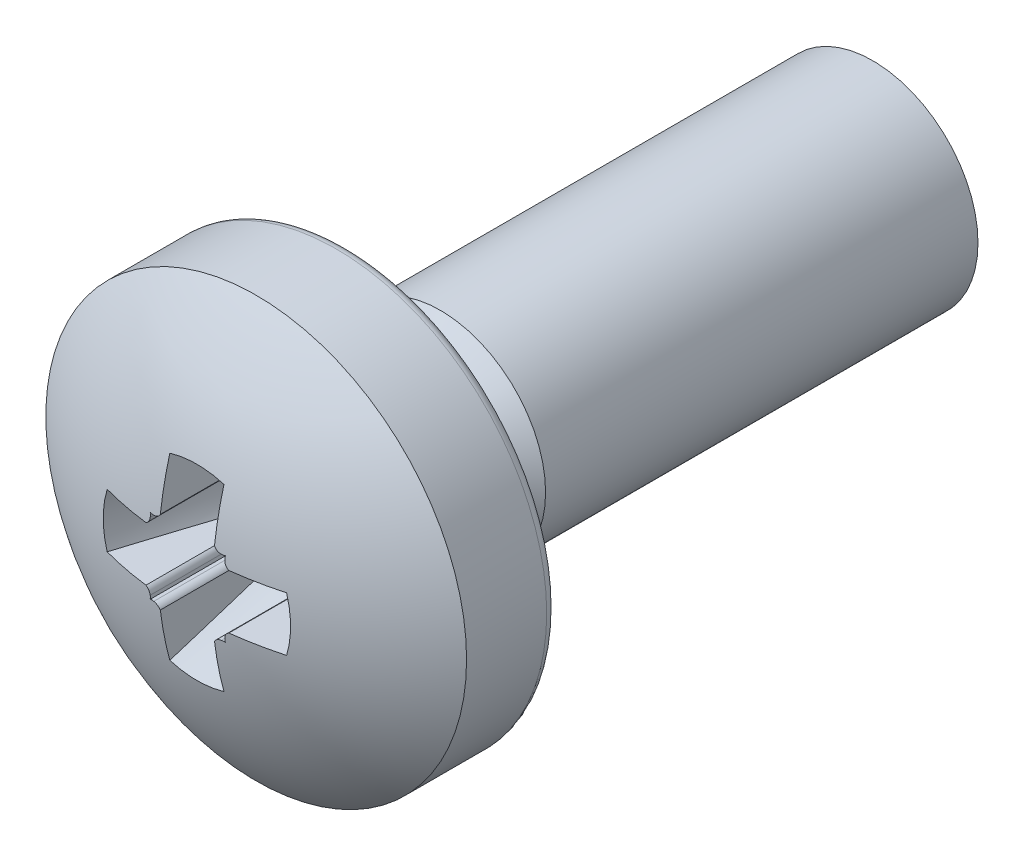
ISO-10303-21;
HEADER;
FILE_DESCRIPTION(('STEP AP214'),'2;1');
FILE_NAME('part.step','',(''),(''),'','','');
FILE_SCHEMA(('AUTOMOTIVE_DESIGN { 1 0 10303 214 1 1 1 1 }'));
ENDSEC;
DATA;
#1=APPLICATION_CONTEXT('core data for automotive mechanical design processes');
#2=APPLICATION_PROTOCOL_DEFINITION('international standard','automotive_design',2000,#1);
#3=PRODUCT_CONTEXT('',#1,'mechanical');
#4=PRODUCT('Part','Part','',(#3));
#5=PRODUCT_RELATED_PRODUCT_CATEGORY('part','',(#4));
#6=PRODUCT_DEFINITION_FORMATION('','',#4);
#7=PRODUCT_DEFINITION_CONTEXT('part definition',#1,'design');
#8=PRODUCT_DEFINITION('design','',#6,#7);
#9=PRODUCT_DEFINITION_SHAPE('','',#8);
#10=(LENGTH_UNIT() NAMED_UNIT(*) SI_UNIT(.MILLI.,.METRE.));
#11=(NAMED_UNIT(*) PLANE_ANGLE_UNIT() SI_UNIT($,.RADIAN.));
#12=(NAMED_UNIT(*) SI_UNIT($,.STERADIAN.) SOLID_ANGLE_UNIT());
#13=UNCERTAINTY_MEASURE_WITH_UNIT(LENGTH_MEASURE(1.E-05),#10,'distance_accuracy_value','');
#14=(GEOMETRIC_REPRESENTATION_CONTEXT(3) GLOBAL_UNCERTAINTY_ASSIGNED_CONTEXT((#13)) GLOBAL_UNIT_ASSIGNED_CONTEXT((#10,
#11,#12)) REPRESENTATION_CONTEXT('',''));
#15=CARTESIAN_POINT('',(0.,0.,0.));
#16=DIRECTION('',(0.,0.,1.));
#17=DIRECTION('',(1.,0.,0.));
#18=AXIS2_PLACEMENT_3D('',#15,#16,#17);
#19=CARTESIAN_POINT('',(0.,0.,-3.4));
#20=DIRECTION('',(1.,0.,0.));
#21=DIRECTION('',(0.,0.,-1.));
#22=AXIS2_PLACEMENT_3D('',#19,#20,#21);
#23=SPHERICAL_SURFACE('',#22,6.5);
#24=CARTESIAN_POINT('',(0.,0.,1.7234753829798));
#25=DIRECTION('',(0.,0.,1.));
#26=DIRECTION('',(1.,0.,0.));
#27=AXIS2_PLACEMENT_3D('',#24,#25,#26);
#28=CIRCLE('',#27,4.);
#29=CARTESIAN_POINT('',(4.,0.,1.7234753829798));
#30=VERTEX_POINT('',#29);
#31=EDGE_CURVE('E309',#30,#30,#28,.T.);
#32=ORIENTED_EDGE('',*,*,#31,.T.);
#33=EDGE_LOOP('',(#32));
#34=FACE_BOUND('',#33,.T.);
#35=CARTESIAN_POINT('',(0.0255182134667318,-0.730746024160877,-3.4));
#36=DIRECTION('',(-0.0348994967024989,0.999390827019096,0.));
#37=DIRECTION('',(0.999390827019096,0.0348994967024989,0.));
#38=AXIS2_PLACEMENT_3D('',#35,#36,#37);
#39=CIRCLE('',#38,6.45874283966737);
#40=CARTESIAN_POINT('',(0.641767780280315,-0.709226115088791,3.02924042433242));
#41=VERTEX_POINT('',#40);
#42=CARTESIAN_POINT('',(0.694396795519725,-0.707388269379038,3.02397189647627));
#43=VERTEX_POINT('',#42);
#44=EDGE_CURVE('E11',#41,#43,#39,.T.);
#45=ORIENTED_EDGE('',*,*,#44,.F.);
#46=CARTESIAN_POINT('',(0.641767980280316,-0.709226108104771,3.02924040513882));
#47=CARTESIAN_POINT('',(0.633441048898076,-0.709509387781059,3.03004051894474));
#48=CARTESIAN_POINT('',(0.6251303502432,-0.710501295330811,3.03074417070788));
#49=CARTESIAN_POINT('',(0.608780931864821,-0.713848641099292,3.03194179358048));
#50=CARTESIAN_POINT('',(0.600741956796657,-0.716202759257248,3.03243596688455));
#51=CARTESIAN_POINT('',(0.585153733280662,-0.7222233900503,3.03319971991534));
#52=CARTESIAN_POINT('',(0.577604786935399,-0.725890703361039,3.03346916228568));
#53=CARTESIAN_POINT('',(0.563216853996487,-0.734435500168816,3.03377504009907));
#54=CARTESIAN_POINT('',(0.556378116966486,-0.739313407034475,3.0338113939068));
#55=CARTESIAN_POINT('',(0.543637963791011,-0.750115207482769,3.03365016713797));
#56=CARTESIAN_POINT('',(0.537732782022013,-0.756034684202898,3.03345355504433));
#57=CARTESIAN_POINT('',(0.527000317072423,-0.768755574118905,3.032834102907));
#58=CARTESIAN_POINT('',(0.522170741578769,-0.775555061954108,3.03241175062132));
#59=CARTESIAN_POINT('',(0.516927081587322,-0.78440617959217,3.03175694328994));
#60=CARTESIAN_POINT('',(0.515945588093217,-0.786141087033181,3.03162393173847));
#61=CARTESIAN_POINT('',(0.514999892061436,-0.78789389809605,3.03148492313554));
#62=B_SPLINE_CURVE_WITH_KNOTS('',3,(#46,#47,#48,#49,#50,#51,#52,#53,#54,#55,#56,#57,#58,#59,#60,
#61),.UNSPECIFIED.,.F.,.F.,(4,2,2,2,2,2,2,4),(0.,0.0250792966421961,0.0501343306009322,
0.0752046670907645,0.10028378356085,0.125259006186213,0.150180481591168,0.156171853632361),.UNSPECIFIED.);
#63=CARTESIAN_POINT('',(0.515,-0.787893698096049,3.03148493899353));
#64=VERTEX_POINT('',#63);
#65=EDGE_CURVE('E900',#41,#64,#62,.T.);
#66=ORIENTED_EDGE('',*,*,#65,.T.);
#67=CARTESIAN_POINT('',(0.515,0.,-3.4));
#68=DIRECTION('',(1.,0.,0.));
#69=DIRECTION('',(0.,-1.,0.));
#70=AXIS2_PLACEMENT_3D('',#67,#68,#69);
#71=CIRCLE('',#70,6.47956595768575);
#72=CARTESIAN_POINT('',(0.515,-1.70562264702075,2.85105002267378));
#73=VERTEX_POINT('',#72);
#74=EDGE_CURVE('E944',#64,#73,#71,.T.);
#75=ORIENTED_EDGE('',*,*,#74,.T.);
#76=CARTESIAN_POINT('',(0.,0.,2.85105002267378));
#77=DIRECTION('',(0.,0.,-1.));
#78=DIRECTION('',(0.,1.,0.));
#79=AXIS2_PLACEMENT_3D('',#76,#77,#78);
#80=CIRCLE('',#79,1.78167719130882);
#81=CARTESIAN_POINT('',(-0.515,-1.70562264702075,2.85105002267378));
#82=VERTEX_POINT('',#81);
#83=EDGE_CURVE('E936',#73,#82,#80,.T.);
#84=ORIENTED_EDGE('',*,*,#83,.T.);
#85=CARTESIAN_POINT('',(-0.515,0.,-3.4));
#86=DIRECTION('',(1.,0.,0.));
#87=DIRECTION('',(0.,-1.,0.));
#88=AXIS2_PLACEMENT_3D('',#85,#86,#87);
#89=CIRCLE('',#88,6.47956595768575);
#90=CARTESIAN_POINT('',(-0.515,-0.78789369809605,3.03148493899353));
#91=VERTEX_POINT('',#90);
#92=EDGE_CURVE('E930',#91,#82,#89,.T.);
#93=ORIENTED_EDGE('',*,*,#92,.F.);
#94=CARTESIAN_POINT('',(-0.641767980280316,-0.709226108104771,3.02924040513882));
#95=CARTESIAN_POINT('',(-0.633441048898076,-0.709509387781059,3.03004051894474));
#96=CARTESIAN_POINT('',(-0.6251303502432,-0.710501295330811,3.03074417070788));
#97=CARTESIAN_POINT('',(-0.608780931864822,-0.713848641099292,3.03194179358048));
#98=CARTESIAN_POINT('',(-0.600741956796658,-0.716202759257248,3.03243596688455));
#99=CARTESIAN_POINT('',(-0.585153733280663,-0.7222233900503,3.03319971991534));
#100=CARTESIAN_POINT('',(-0.5776047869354,-0.725890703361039,3.03346916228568));
#101=CARTESIAN_POINT('',(-0.563216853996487,-0.734435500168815,3.03377504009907));
#102=CARTESIAN_POINT('',(-0.556378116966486,-0.739313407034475,3.0338113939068));
#103=CARTESIAN_POINT('',(-0.543637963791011,-0.750115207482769,3.03365016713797));
#104=CARTESIAN_POINT('',(-0.537732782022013,-0.756034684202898,3.03345355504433));
#105=CARTESIAN_POINT('',(-0.527000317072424,-0.768755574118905,3.032834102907));
#106=CARTESIAN_POINT('',(-0.52217074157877,-0.775555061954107,3.03241175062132));
#107=CARTESIAN_POINT('',(-0.516927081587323,-0.784406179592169,3.03175694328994));
#108=CARTESIAN_POINT('',(-0.515945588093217,-0.786141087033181,3.03162393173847));
#109=CARTESIAN_POINT('',(-0.514999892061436,-0.787893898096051,3.03148492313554));
#110=B_SPLINE_CURVE_WITH_KNOTS('',3,(#94,#95,#96,#97,#98,#99,#100,#101,#102,#103,#104,#105,#106,
#107,#108,#109),.UNSPECIFIED.,.F.,.F.,(4,2,2,2,2,2,2,4),(0.,0.0250792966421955,
0.0501343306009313,0.0752046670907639,0.10028378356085,0.125259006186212,0.150180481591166,
0.156171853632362),.UNSPECIFIED.);
#111=CARTESIAN_POINT('',(-0.641767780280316,-0.709226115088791,3.02924042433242));
#112=VERTEX_POINT('',#111);
#113=EDGE_CURVE('E924',#112,#91,#110,.T.);
#114=ORIENTED_EDGE('',*,*,#113,.F.);
#115=CARTESIAN_POINT('',(-0.0255182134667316,-0.730746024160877,-3.4));
#116=DIRECTION('',(-0.0348994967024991,-0.999390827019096,0.));
#117=DIRECTION('',(-0.999390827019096,0.0348994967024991,0.));
#118=AXIS2_PLACEMENT_3D('',#115,#116,#117);
#119=CIRCLE('',#118,6.45874283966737);
#120=CARTESIAN_POINT('',(-0.694396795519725,-0.707388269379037,3.02397189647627));
#121=VERTEX_POINT('',#120);
#122=EDGE_CURVE('E931',#112,#121,#119,.T.);
#123=ORIENTED_EDGE('',*,*,#122,.T.);
#124=CARTESIAN_POINT('',(-2.18973872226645,2.18973872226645,-1.02377385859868));
#125=DIRECTION('',(-0.560985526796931,0.560985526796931,0.608761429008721));
#126=DIRECTION('',(0.,-0.735373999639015,0.677661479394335));
#127=AXIS2_PLACEMENT_3D('',#124,#125,#126);
#128=CIRCLE('',#127,5.19746457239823);
#129=CARTESIAN_POINT('',(-0.707945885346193,-0.718048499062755,3.02130975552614));
#130=VERTEX_POINT('',#129);
#131=EDGE_CURVE('E970',#130,#121,#128,.T.);
#132=ORIENTED_EDGE('',*,*,#131,.F.);
#133=CARTESIAN_POINT('',(0.441436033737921,0.441436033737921,2.85845537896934));
#134=DIRECTION('',(0.0701860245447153,0.0701860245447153,0.995061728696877));
#135=DIRECTION('',(0.9975216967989,0.,-0.0703595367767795));
#136=AXIS2_PLACEMENT_3D('',#133,#134,#135);
#137=CIRCLE('',#136,1.64073298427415);
#138=CARTESIAN_POINT('',(-0.718048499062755,-0.707945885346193,3.02130975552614));
#139=VERTEX_POINT('',#138);
#140=EDGE_CURVE('E967',#139,#130,#137,.T.);
#141=ORIENTED_EDGE('',*,*,#140,.F.);
#142=CARTESIAN_POINT('',(2.18973872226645,-2.18973872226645,-1.02377385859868));
#143=DIRECTION('',(-0.560985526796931,0.560985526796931,-0.608761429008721));
#144=DIRECTION('',(-0.735373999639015,0.,0.677661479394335));
#145=AXIS2_PLACEMENT_3D('',#142,#143,#144);
#146=CIRCLE('',#145,5.19746457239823);
#147=CARTESIAN_POINT('',(-0.707388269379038,-0.694396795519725,3.02397189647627));
#148=VERTEX_POINT('',#147);
#149=EDGE_CURVE('E968',#139,#148,#146,.T.);
#150=ORIENTED_EDGE('',*,*,#149,.T.);
#151=CARTESIAN_POINT('',(-0.730746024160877,-0.0255182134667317,-3.4));
#152=DIRECTION('',(0.999390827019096,0.0348994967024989,0.));
#153=DIRECTION('',(0.0348994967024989,-0.999390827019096,0.));
#154=AXIS2_PLACEMENT_3D('',#151,#152,#153);
#155=CIRCLE('',#154,6.45874283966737);
#156=CARTESIAN_POINT('',(-0.709226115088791,-0.641767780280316,3.02924042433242));
#157=VERTEX_POINT('',#156);
#158=EDGE_CURVE('E584',#157,#148,#155,.T.);
#159=ORIENTED_EDGE('',*,*,#158,.F.);
#160=CARTESIAN_POINT('',(-0.709226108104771,-0.641767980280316,3.02924040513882));
#161=CARTESIAN_POINT('',(-0.709509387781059,-0.633441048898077,3.03004051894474));
#162=CARTESIAN_POINT('',(-0.710501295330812,-0.625130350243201,3.03074417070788));
#163=CARTESIAN_POINT('',(-0.713848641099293,-0.608780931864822,3.03194179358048));
#164=CARTESIAN_POINT('',(-0.716202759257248,-0.600741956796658,3.03243596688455));
#165=CARTESIAN_POINT('',(-0.7222233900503,-0.585153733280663,3.03319971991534));
#166=CARTESIAN_POINT('',(-0.72589070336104,-0.5776047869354,3.03346916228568));
#167=CARTESIAN_POINT('',(-0.734435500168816,-0.563216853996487,3.03377504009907));
#168=CARTESIAN_POINT('',(-0.739313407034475,-0.556378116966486,3.0338113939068));
#169=CARTESIAN_POINT('',(-0.750115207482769,-0.543637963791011,3.03365016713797));
#170=CARTESIAN_POINT('',(-0.756034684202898,-0.537732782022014,3.03345355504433));
#171=CARTESIAN_POINT('',(-0.768755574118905,-0.527000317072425,3.032834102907));
#172=CARTESIAN_POINT('',(-0.775555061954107,-0.522170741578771,3.03241175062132));
#173=CARTESIAN_POINT('',(-0.784406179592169,-0.516927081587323,3.03175694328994));
#174=CARTESIAN_POINT('',(-0.786141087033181,-0.515945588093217,3.03162393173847));
#175=CARTESIAN_POINT('',(-0.78789389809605,-0.514999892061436,3.03148492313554));
#176=B_SPLINE_CURVE_WITH_KNOTS('',3,(#160,#161,#162,#163,#164,#165,#166,#167,#168,#169,#170,
#171,#172,#173,#174,#175),.UNSPECIFIED.,.F.,.F.,(4,2,2,2,2,2,2,4),(0.,0.0250792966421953,
0.0501343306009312,0.075204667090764,0.10028378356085,0.125259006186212,0.150180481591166,
0.156171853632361),.UNSPECIFIED.);
#177=CARTESIAN_POINT('',(-0.78789369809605,-0.515,3.03148493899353));
#178=VERTEX_POINT('',#177);
#179=EDGE_CURVE('E578',#157,#178,#176,.T.);
#180=ORIENTED_EDGE('',*,*,#179,.T.);
#181=CARTESIAN_POINT('',(0.,-0.515,-3.4));
#182=DIRECTION('',(0.,1.,0.));
#183=DIRECTION('',(1.,0.,0.));
#184=AXIS2_PLACEMENT_3D('',#181,#182,#183);
#185=CIRCLE('',#184,6.47956595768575);
#186=CARTESIAN_POINT('',(-1.70562264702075,-0.515,2.85105002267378));
#187=VERTEX_POINT('',#186);
#188=EDGE_CURVE('E569',#187,#178,#185,.T.);
#189=ORIENTED_EDGE('',*,*,#188,.F.);
#190=CARTESIAN_POINT('',(0.,0.,2.85105002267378));
#191=DIRECTION('',(0.,0.,-1.));
#192=DIRECTION('',(0.,1.,0.));
#193=AXIS2_PLACEMENT_3D('',#190,#191,#192);
#194=CIRCLE('',#193,1.78167719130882);
#195=CARTESIAN_POINT('',(-1.70562264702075,0.515,2.85105002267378));
#196=VERTEX_POINT('',#195);
#197=EDGE_CURVE('E563',#187,#196,#194,.T.);
#198=ORIENTED_EDGE('',*,*,#197,.T.);
#199=CARTESIAN_POINT('',(0.,0.515,-3.4));
#200=DIRECTION('',(0.,1.,0.));
#201=DIRECTION('',(1.,0.,0.));
#202=AXIS2_PLACEMENT_3D('',#199,#200,#201);
#203=CIRCLE('',#202,6.47956595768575);
#204=CARTESIAN_POINT('',(-0.78789369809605,0.515,3.03148493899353));
#205=VERTEX_POINT('',#204);
#206=EDGE_CURVE('E610',#196,#205,#203,.T.);
#207=ORIENTED_EDGE('',*,*,#206,.T.);
#208=CARTESIAN_POINT('',(-0.709226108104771,0.641767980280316,3.02924040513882));
#209=CARTESIAN_POINT('',(-0.70950938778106,0.633441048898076,3.03004051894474));
#210=CARTESIAN_POINT('',(-0.710501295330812,0.6251303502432,3.03074417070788));
#211=CARTESIAN_POINT('',(-0.713848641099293,0.608780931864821,3.03194179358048));
#212=CARTESIAN_POINT('',(-0.716202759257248,0.600741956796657,3.03243596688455));
#213=CARTESIAN_POINT('',(-0.7222233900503,0.585153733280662,3.03319971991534));
#214=CARTESIAN_POINT('',(-0.72589070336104,0.577604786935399,3.03346916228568));
#215=CARTESIAN_POINT('',(-0.734435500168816,0.563216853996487,3.03377504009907));
#216=CARTESIAN_POINT('',(-0.739313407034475,0.556378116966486,3.0338113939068));
#217=CARTESIAN_POINT('',(-0.750115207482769,0.543637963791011,3.03365016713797));
#218=CARTESIAN_POINT('',(-0.756034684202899,0.537732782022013,3.03345355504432));
#219=CARTESIAN_POINT('',(-0.768755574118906,0.527000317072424,3.032834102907));
#220=CARTESIAN_POINT('',(-0.775555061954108,0.522170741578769,3.03241175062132));
#221=CARTESIAN_POINT('',(-0.78440617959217,0.516927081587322,3.03175694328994));
#222=CARTESIAN_POINT('',(-0.786141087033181,0.515945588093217,3.03162393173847));
#223=CARTESIAN_POINT('',(-0.78789389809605,0.514999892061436,3.03148492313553));
#224=B_SPLINE_CURVE_WITH_KNOTS('',3,(#208,#209,#210,#211,#212,#213,#214,#215,#216,#217,#218,
#219,#220,#221,#222,#223),.UNSPECIFIED.,.F.,.F.,(4,2,2,2,2,2,2,4),(0.,0.0250792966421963,
0.0501343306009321,0.0752046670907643,0.10028378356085,0.125259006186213,0.150180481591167,
0.156171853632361),.UNSPECIFIED.);
#225=CARTESIAN_POINT('',(-0.709226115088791,0.641767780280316,3.02924042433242));
#226=VERTEX_POINT('',#225);
#227=EDGE_CURVE('E602',#226,#205,#224,.T.);
#228=ORIENTED_EDGE('',*,*,#227,.F.);
#229=CARTESIAN_POINT('',(-0.730746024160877,0.0255182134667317,-3.4));
#230=DIRECTION('',(-0.999390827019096,0.0348994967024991,0.));
#231=DIRECTION('',(0.0348994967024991,0.999390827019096,0.));
#232=AXIS2_PLACEMENT_3D('',#229,#230,#231);
#233=CIRCLE('',#232,6.45874283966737);
#234=CARTESIAN_POINT('',(-0.707388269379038,0.694396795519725,3.02397189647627));
#235=VERTEX_POINT('',#234);
#236=EDGE_CURVE('E40',#226,#235,#233,.T.);
#237=ORIENTED_EDGE('',*,*,#236,.T.);
#238=CARTESIAN_POINT('',(2.18973872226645,2.18973872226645,-1.02377385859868));
#239=DIRECTION('',(0.560985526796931,0.560985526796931,0.608761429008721));
#240=DIRECTION('',(0.735373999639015,0.,-0.677661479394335));
#241=AXIS2_PLACEMENT_3D('',#238,#239,#240);
#242=CIRCLE('',#241,5.19746457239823);
#243=CARTESIAN_POINT('',(-0.718048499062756,0.707945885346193,3.02130975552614));
#244=VERTEX_POINT('',#243);
#245=EDGE_CURVE('E344',#244,#235,#242,.T.);
#246=ORIENTED_EDGE('',*,*,#245,.F.);
#247=CARTESIAN_POINT('',(0.44143603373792,-0.44143603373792,2.85845537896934));
#248=DIRECTION('',(0.0701860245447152,-0.0701860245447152,0.995061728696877));
#249=DIRECTION('',(0.9975216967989,0.,-0.0703595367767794));
#250=AXIS2_PLACEMENT_3D('',#247,#248,#249);
#251=CIRCLE('',#250,1.64073298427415);
#252=CARTESIAN_POINT('',(-0.707945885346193,0.718048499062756,3.02130975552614));
#253=VERTEX_POINT('',#252);
#254=EDGE_CURVE('E339',#253,#244,#251,.T.);
#255=ORIENTED_EDGE('',*,*,#254,.F.);
#256=CARTESIAN_POINT('',(-2.18973872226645,-2.18973872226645,-1.02377385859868));
#257=DIRECTION('',(0.560985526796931,0.560985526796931,-0.608761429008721));
#258=DIRECTION('',(-0.735373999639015,0.,-0.677661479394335));
#259=AXIS2_PLACEMENT_3D('',#256,#257,#258);
#260=CIRCLE('',#259,5.19746457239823);
#261=CARTESIAN_POINT('',(-0.694396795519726,0.707388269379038,3.02397189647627));
#262=VERTEX_POINT('',#261);
#263=EDGE_CURVE('E341',#253,#262,#260,.T.);
#264=ORIENTED_EDGE('',*,*,#263,.T.);
#265=CARTESIAN_POINT('',(-0.0255182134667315,0.730746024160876,-3.4));
#266=DIRECTION('',(0.034899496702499,-0.999390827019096,0.));
#267=DIRECTION('',(-0.999390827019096,-0.034899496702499,0.));
#268=AXIS2_PLACEMENT_3D('',#265,#266,#267);
#269=CIRCLE('',#268,6.45874283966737);
#270=CARTESIAN_POINT('',(-0.641767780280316,0.709226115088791,3.02924042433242));
#271=VERTEX_POINT('',#270);
#272=EDGE_CURVE('E346',#271,#262,#269,.T.);
#273=ORIENTED_EDGE('',*,*,#272,.F.);
#274=CARTESIAN_POINT('',(-0.641767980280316,0.709226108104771,3.02924040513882));
#275=CARTESIAN_POINT('',(-0.633441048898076,0.709509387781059,3.03004051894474));
#276=CARTESIAN_POINT('',(-0.6251303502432,0.710501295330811,3.03074417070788));
#277=CARTESIAN_POINT('',(-0.608780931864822,0.713848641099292,3.03194179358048));
#278=CARTESIAN_POINT('',(-0.600741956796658,0.716202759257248,3.03243596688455));
#279=CARTESIAN_POINT('',(-0.585153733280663,0.7222233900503,3.03319971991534));
#280=CARTESIAN_POINT('',(-0.5776047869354,0.725890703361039,3.03346916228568));
#281=CARTESIAN_POINT('',(-0.563216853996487,0.734435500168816,3.03377504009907));
#282=CARTESIAN_POINT('',(-0.556378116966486,0.739313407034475,3.0338113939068));
#283=CARTESIAN_POINT('',(-0.543637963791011,0.750115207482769,3.03365016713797));
#284=CARTESIAN_POINT('',(-0.537732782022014,0.756034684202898,3.03345355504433));
#285=CARTESIAN_POINT('',(-0.527000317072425,0.768755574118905,3.032834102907));
#286=CARTESIAN_POINT('',(-0.52217074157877,0.775555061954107,3.03241175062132));
#287=CARTESIAN_POINT('',(-0.516927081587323,0.784406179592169,3.03175694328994));
#288=CARTESIAN_POINT('',(-0.515945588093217,0.786141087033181,3.03162393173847));
#289=CARTESIAN_POINT('',(-0.514999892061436,0.787893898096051,3.03148492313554));
#290=B_SPLINE_CURVE_WITH_KNOTS('',3,(#274,#275,#276,#277,#278,#279,#280,#281,#282,#283,#284,
#285,#286,#287,#288,#289),.UNSPECIFIED.,.F.,.F.,(4,2,2,2,2,2,2,4),(0.,0.0250792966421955,
0.0501343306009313,0.075204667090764,0.10028378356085,0.125259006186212,0.150180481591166,
0.156171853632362),.UNSPECIFIED.);
#291=CARTESIAN_POINT('',(-0.515,0.787893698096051,3.03148493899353));
#292=VERTEX_POINT('',#291);
#293=EDGE_CURVE('E348',#271,#292,#290,.T.);
#294=ORIENTED_EDGE('',*,*,#293,.T.);
#295=CARTESIAN_POINT('',(-0.515,0.,-3.4));
#296=DIRECTION('',(1.,0.,0.));
#297=DIRECTION('',(0.,0.,-1.));
#298=AXIS2_PLACEMENT_3D('',#295,#296,#297);
#299=CIRCLE('',#298,6.47956595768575);
#300=CARTESIAN_POINT('',(-0.515,1.70562264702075,2.85105002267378));
#301=VERTEX_POINT('',#300);
#302=EDGE_CURVE('E355',#301,#292,#299,.T.);
#303=ORIENTED_EDGE('',*,*,#302,.F.);
#304=CARTESIAN_POINT('',(0.,0.,2.85105002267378));
#305=DIRECTION('',(0.,0.,-1.));
#306=DIRECTION('',(0.,1.,0.));
#307=AXIS2_PLACEMENT_3D('',#304,#305,#306);
#308=CIRCLE('',#307,1.78167719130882);
#309=CARTESIAN_POINT('',(0.515,1.70562264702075,2.85105002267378));
#310=VERTEX_POINT('',#309);
#311=EDGE_CURVE('E1076',#301,#310,#308,.T.);
#312=ORIENTED_EDGE('',*,*,#311,.T.);
#313=CARTESIAN_POINT('',(0.515,0.,-3.4));
#314=DIRECTION('',(1.,0.,0.));
#315=DIRECTION('',(0.,0.,-1.));
#316=AXIS2_PLACEMENT_3D('',#313,#314,#315);
#317=CIRCLE('',#316,6.47956595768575);
#318=CARTESIAN_POINT('',(0.515,0.787893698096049,3.03148493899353));
#319=VERTEX_POINT('',#318);
#320=EDGE_CURVE('E608',#310,#319,#317,.T.);
#321=ORIENTED_EDGE('',*,*,#320,.T.);
#322=CARTESIAN_POINT('',(0.641767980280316,0.709226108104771,3.02924040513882));
#323=CARTESIAN_POINT('',(0.633441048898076,0.709509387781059,3.03004051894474));
#324=CARTESIAN_POINT('',(0.6251303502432,0.710501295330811,3.03074417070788));
#325=CARTESIAN_POINT('',(0.608780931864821,0.713848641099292,3.03194179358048));
#326=CARTESIAN_POINT('',(0.600741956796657,0.716202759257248,3.03243596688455));
#327=CARTESIAN_POINT('',(0.585153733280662,0.7222233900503,3.03319971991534));
#328=CARTESIAN_POINT('',(0.577604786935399,0.725890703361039,3.03346916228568));
#329=CARTESIAN_POINT('',(0.563216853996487,0.734435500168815,3.03377504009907));
#330=CARTESIAN_POINT('',(0.556378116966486,0.739313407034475,3.0338113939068));
#331=CARTESIAN_POINT('',(0.543637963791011,0.750115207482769,3.03365016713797));
#332=CARTESIAN_POINT('',(0.537732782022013,0.756034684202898,3.03345355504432));
#333=CARTESIAN_POINT('',(0.527000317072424,0.768755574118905,3.032834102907));
#334=CARTESIAN_POINT('',(0.522170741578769,0.775555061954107,3.03241175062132));
#335=CARTESIAN_POINT('',(0.516927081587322,0.784406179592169,3.03175694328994));
#336=CARTESIAN_POINT('',(0.515945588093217,0.78614108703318,3.03162393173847));
#337=CARTESIAN_POINT('',(0.514999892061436,0.787893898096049,3.03148492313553));
#338=B_SPLINE_CURVE_WITH_KNOTS('',3,(#322,#323,#324,#325,#326,#327,#328,#329,#330,#331,#332,
#333,#334,#335,#336,#337),.UNSPECIFIED.,.F.,.F.,(4,2,2,2,2,2,2,4),(0.,0.0250792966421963,
0.0501343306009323,0.0752046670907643,0.10028378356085,0.125259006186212,0.150180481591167,
0.156171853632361),.UNSPECIFIED.);
#339=CARTESIAN_POINT('',(0.641767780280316,0.709226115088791,3.02924042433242));
#340=VERTEX_POINT('',#339);
#341=EDGE_CURVE('E556',#340,#319,#338,.T.);
#342=ORIENTED_EDGE('',*,*,#341,.F.);
#343=CARTESIAN_POINT('',(0.0255182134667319,0.730746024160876,-3.4));
#344=DIRECTION('',(0.034899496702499,0.999390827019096,0.));
#345=DIRECTION('',(0.999390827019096,-0.034899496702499,0.));
#346=AXIS2_PLACEMENT_3D('',#343,#344,#345);
#347=CIRCLE('',#346,6.45874283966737);
#348=CARTESIAN_POINT('',(0.694396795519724,0.707388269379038,3.02397189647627));
#349=VERTEX_POINT('',#348);
#350=EDGE_CURVE('E562',#340,#349,#347,.T.);
#351=ORIENTED_EDGE('',*,*,#350,.T.);
#352=CARTESIAN_POINT('',(2.18973872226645,-2.18973872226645,-1.02377385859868));
#353=DIRECTION('',(0.560985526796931,-0.560985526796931,0.608761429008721));
#354=DIRECTION('',(0.,-0.735373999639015,-0.677661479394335));
#355=AXIS2_PLACEMENT_3D('',#352,#353,#354);
#356=CIRCLE('',#355,5.19746457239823);
#357=CARTESIAN_POINT('',(0.707945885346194,0.718048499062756,3.02130975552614));
#358=VERTEX_POINT('',#357);
#359=EDGE_CURVE('E567',#358,#349,#356,.T.);
#360=ORIENTED_EDGE('',*,*,#359,.F.);
#361=CARTESIAN_POINT('',(-0.44143603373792,-0.441436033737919,2.85845537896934));
#362=DIRECTION('',(-0.0701860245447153,-0.0701860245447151,0.995061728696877));
#363=DIRECTION('',(0.9975216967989,0.,0.0703595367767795));
#364=AXIS2_PLACEMENT_3D('',#361,#362,#363);
#365=CIRCLE('',#364,1.64073298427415);
#366=CARTESIAN_POINT('',(0.718048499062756,0.707945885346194,3.02130975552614));
#367=VERTEX_POINT('',#366);
#368=EDGE_CURVE('E571',#367,#358,#365,.T.);
#369=ORIENTED_EDGE('',*,*,#368,.F.);
#370=CARTESIAN_POINT('',(-2.18973872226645,2.18973872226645,-1.02377385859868));
#371=DIRECTION('',(0.560985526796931,-0.560985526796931,-0.608761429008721));
#372=DIRECTION('',(0.,0.735373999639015,-0.677661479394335));
#373=AXIS2_PLACEMENT_3D('',#370,#371,#372);
#374=CIRCLE('',#373,5.19746457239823);
#375=CARTESIAN_POINT('',(0.707388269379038,0.694396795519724,3.02397189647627));
#376=VERTEX_POINT('',#375);
#377=EDGE_CURVE('E573',#367,#376,#374,.T.);
#378=ORIENTED_EDGE('',*,*,#377,.T.);
#379=CARTESIAN_POINT('',(0.730746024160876,0.0255182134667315,-3.4));
#380=DIRECTION('',(-0.999390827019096,-0.0348994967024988,0.));
#381=DIRECTION('',(-0.0348994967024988,0.999390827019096,0.));
#382=AXIS2_PLACEMENT_3D('',#379,#380,#381);
#383=CIRCLE('',#382,6.45874283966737);
#384=CARTESIAN_POINT('',(0.709226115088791,0.641767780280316,3.02924042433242));
#385=VERTEX_POINT('',#384);
#386=EDGE_CURVE('E576',#385,#376,#383,.T.);
#387=ORIENTED_EDGE('',*,*,#386,.F.);
#388=CARTESIAN_POINT('',(0.709226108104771,0.641767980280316,3.02924040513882));
#389=CARTESIAN_POINT('',(0.709509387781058,0.633441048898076,3.03004051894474));
#390=CARTESIAN_POINT('',(0.710501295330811,0.6251303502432,3.03074417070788));
#391=CARTESIAN_POINT('',(0.713848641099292,0.608780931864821,3.03194179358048));
#392=CARTESIAN_POINT('',(0.716202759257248,0.600741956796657,3.03243596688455));
#393=CARTESIAN_POINT('',(0.7222233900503,0.585153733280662,3.03319971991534));
#394=CARTESIAN_POINT('',(0.725890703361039,0.577604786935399,3.03346916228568));
#395=CARTESIAN_POINT('',(0.734435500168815,0.563216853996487,3.03377504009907));
#396=CARTESIAN_POINT('',(0.739313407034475,0.556378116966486,3.0338113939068));
#397=CARTESIAN_POINT('',(0.750115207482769,0.543637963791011,3.03365016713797));
#398=CARTESIAN_POINT('',(0.756034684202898,0.537732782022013,3.03345355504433));
#399=CARTESIAN_POINT('',(0.768755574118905,0.527000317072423,3.032834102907));
#400=CARTESIAN_POINT('',(0.775555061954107,0.522170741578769,3.03241175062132));
#401=CARTESIAN_POINT('',(0.784406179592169,0.516927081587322,3.03175694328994));
#402=CARTESIAN_POINT('',(0.786141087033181,0.515945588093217,3.03162393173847));
#403=CARTESIAN_POINT('',(0.78789389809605,0.514999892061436,3.03148492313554));
#404=B_SPLINE_CURVE_WITH_KNOTS('',3,(#388,#389,#390,#391,#392,#393,#394,#395,#396,#397,#398,
#399,#400,#401,#402,#403),.UNSPECIFIED.,.F.,.F.,(4,2,2,2,2,2,2,4),(0.,0.0250792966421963,
0.0501343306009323,0.0752046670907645,0.10028378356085,0.125259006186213,0.150180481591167,
0.156171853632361),.UNSPECIFIED.);
#405=CARTESIAN_POINT('',(0.78789369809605,0.515,3.03148493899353));
#406=VERTEX_POINT('',#405);
#407=EDGE_CURVE('E961',#385,#406,#404,.T.);
#408=ORIENTED_EDGE('',*,*,#407,.T.);
#409=CARTESIAN_POINT('',(0.,0.515,-3.4));
#410=DIRECTION('',(0.,1.,0.));
#411=DIRECTION('',(1.,0.,0.));
#412=AXIS2_PLACEMENT_3D('',#409,#410,#411);
#413=CIRCLE('',#412,6.47956595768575);
#414=CARTESIAN_POINT('',(1.70562264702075,0.515,2.85105002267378));
#415=VERTEX_POINT('',#414);
#416=EDGE_CURVE('E972',#406,#415,#413,.T.);
#417=ORIENTED_EDGE('',*,*,#416,.T.);
#418=CARTESIAN_POINT('',(0.,0.,2.85105002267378));
#419=DIRECTION('',(0.,0.,-1.));
#420=DIRECTION('',(0.,1.,0.));
#421=AXIS2_PLACEMENT_3D('',#418,#419,#420);
#422=CIRCLE('',#421,1.78167719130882);
#423=CARTESIAN_POINT('',(1.70562264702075,-0.515,2.85105002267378));
#424=VERTEX_POINT('',#423);
#425=EDGE_CURVE('E974',#415,#424,#422,.T.);
#426=ORIENTED_EDGE('',*,*,#425,.T.);
#427=CARTESIAN_POINT('',(0.,-0.515,-3.4));
#428=DIRECTION('',(0.,1.,0.));
#429=DIRECTION('',(1.,0.,0.));
#430=AXIS2_PLACEMENT_3D('',#427,#428,#429);
#431=CIRCLE('',#430,6.47956595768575);
#432=CARTESIAN_POINT('',(0.787893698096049,-0.515,3.03148493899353));
#433=VERTEX_POINT('',#432);
#434=EDGE_CURVE('E934',#433,#424,#431,.T.);
#435=ORIENTED_EDGE('',*,*,#434,.F.);
#436=CARTESIAN_POINT('',(0.70922610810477,-0.641767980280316,3.02924040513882));
#437=CARTESIAN_POINT('',(0.709509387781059,-0.633441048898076,3.03004051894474));
#438=CARTESIAN_POINT('',(0.710501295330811,-0.6251303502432,3.03074417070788));
#439=CARTESIAN_POINT('',(0.713848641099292,-0.608780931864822,3.03194179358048));
#440=CARTESIAN_POINT('',(0.716202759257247,-0.600741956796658,3.03243596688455));
#441=CARTESIAN_POINT('',(0.722223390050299,-0.585153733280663,3.03319971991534));
#442=CARTESIAN_POINT('',(0.725890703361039,-0.5776047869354,3.03346916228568));
#443=CARTESIAN_POINT('',(0.734435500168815,-0.563216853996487,3.03377504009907));
#444=CARTESIAN_POINT('',(0.739313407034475,-0.556378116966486,3.0338113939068));
#445=CARTESIAN_POINT('',(0.750115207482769,-0.543637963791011,3.03365016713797));
#446=CARTESIAN_POINT('',(0.756034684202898,-0.537732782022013,3.03345355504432));
#447=CARTESIAN_POINT('',(0.768755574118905,-0.527000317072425,3.032834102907));
#448=CARTESIAN_POINT('',(0.775555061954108,-0.522170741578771,3.03241175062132));
#449=CARTESIAN_POINT('',(0.784406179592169,-0.516927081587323,3.03175694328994));
#450=CARTESIAN_POINT('',(0.78614108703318,-0.515945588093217,3.03162393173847));
#451=CARTESIAN_POINT('',(0.787893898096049,-0.514999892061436,3.03148492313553));
#452=B_SPLINE_CURVE_WITH_KNOTS('',3,(#436,#437,#438,#439,#440,#441,#442,#443,#444,#445,#446,
#447,#448,#449,#450,#451),.UNSPECIFIED.,.F.,.F.,(4,2,2,2,2,2,2,4),(0.,0.0250792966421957,
0.0501343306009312,0.0752046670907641,0.10028378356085,0.125259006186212,0.150180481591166,
0.156171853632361),.UNSPECIFIED.);
#453=CARTESIAN_POINT('',(0.709226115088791,-0.641767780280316,3.02924042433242));
#454=VERTEX_POINT('',#453);
#455=EDGE_CURVE('E939',#454,#433,#452,.T.);
#456=ORIENTED_EDGE('',*,*,#455,.F.);
#457=CARTESIAN_POINT('',(0.730746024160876,-0.0255182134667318,-3.4));
#458=DIRECTION('',(0.999390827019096,-0.0348994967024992,0.));
#459=DIRECTION('',(-0.0348994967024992,-0.999390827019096,0.));
#460=AXIS2_PLACEMENT_3D('',#457,#458,#459);
#461=CIRCLE('',#460,6.45874283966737);
#462=CARTESIAN_POINT('',(0.707388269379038,-0.694396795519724,3.02397189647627));
#463=VERTEX_POINT('',#462);
#464=EDGE_CURVE('E1117',#454,#463,#461,.T.);
#465=ORIENTED_EDGE('',*,*,#464,.T.);
#466=CARTESIAN_POINT('',(-2.18973872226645,-2.18973872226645,-1.02377385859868));
#467=DIRECTION('',(-0.560985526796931,-0.560985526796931,0.608761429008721));
#468=DIRECTION('',(0.735373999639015,0.,0.677661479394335));
#469=AXIS2_PLACEMENT_3D('',#466,#467,#468);
#470=CIRCLE('',#469,5.19746457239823);
#471=CARTESIAN_POINT('',(0.718048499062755,-0.707945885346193,3.02130975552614));
#472=VERTEX_POINT('',#471);
#473=EDGE_CURVE('E907',#472,#463,#470,.T.);
#474=ORIENTED_EDGE('',*,*,#473,.F.);
#475=CARTESIAN_POINT('',(-0.44143603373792,0.441436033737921,2.85845537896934));
#476=DIRECTION('',(-0.0701860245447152,0.0701860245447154,0.995061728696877));
#477=DIRECTION('',(0.,-0.9975216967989,0.0703595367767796));
#478=AXIS2_PLACEMENT_3D('',#475,#476,#477);
#479=CIRCLE('',#478,1.64073298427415);
#480=CARTESIAN_POINT('',(0.707945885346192,-0.718048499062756,3.02130975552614));
#481=VERTEX_POINT('',#480);
#482=EDGE_CURVE('E899',#481,#472,#479,.T.);
#483=ORIENTED_EDGE('',*,*,#482,.F.);
#484=CARTESIAN_POINT('',(2.18973872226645,2.18973872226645,-1.02377385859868));
#485=DIRECTION('',(-0.560985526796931,-0.560985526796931,-0.608761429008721));
#486=DIRECTION('',(0.,0.735373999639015,-0.677661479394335));
#487=AXIS2_PLACEMENT_3D('',#484,#485,#486);
#488=CIRCLE('',#487,5.19746457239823);
#489=EDGE_CURVE('E25',#481,#43,#488,.T.);
#490=ORIENTED_EDGE('',*,*,#489,.T.);
#491=EDGE_LOOP('',(#45,#66,#75,#84,#93,#114,#123,#132,#141,#150,#159,#180,#189,#198,#207,#228,
#237,#246,#255,#264,#273,#294,#303,#312,#321,#342,#351,#360,#369,#378,#387,#408,#417,#426,#435,
#456,#465,#474,#483,#490));
#492=FACE_BOUND('',#491,.T.);
#493=ADVANCED_FACE('F17',(#34,#492),#23,.T.);
#494=CARTESIAN_POINT('',(0.,0.,-10.));
#495=DIRECTION('',(0.,0.,1.));
#496=DIRECTION('',(1.,0.,0.));
#497=AXIS2_PLACEMENT_3D('',#494,#495,#496);
#498=PLANE('',#497);
#499=CARTESIAN_POINT('',(0.,0.,-10.));
#500=DIRECTION('',(0.,0.,1.));
#501=DIRECTION('',(1.,0.,0.));
#502=AXIS2_PLACEMENT_3D('',#499,#500,#501);
#503=CIRCLE('',#502,2.);
#504=CARTESIAN_POINT('',(2.,0.,-10.));
#505=VERTEX_POINT('',#504);
#506=EDGE_CURVE('E336',#505,#505,#503,.T.);
#507=ORIENTED_EDGE('',*,*,#506,.F.);
#508=EDGE_LOOP('',(#507));
#509=FACE_BOUND('',#508,.T.);
#510=ADVANCED_FACE('F701',(#509),#498,.F.);
#511=CARTESIAN_POINT('',(0.,0.,0.));
#512=DIRECTION('',(0.,0.,1.));
#513=DIRECTION('',(1.,0.,0.));
#514=AXIS2_PLACEMENT_3D('',#511,#512,#513);
#515=CYLINDRICAL_SURFACE('',#514,2.);
#516=CARTESIAN_POINT('',(0.,0.,-1.778875));
#517=DIRECTION('',(0.,0.,1.));
#518=DIRECTION('',(1.,0.,0.));
#519=AXIS2_PLACEMENT_3D('',#516,#517,#518);
#520=CIRCLE('',#519,2.);
#521=CARTESIAN_POINT('',(2.,0.,-1.778875));
#522=VERTEX_POINT('',#521);
#523=EDGE_CURVE('E333',#522,#522,#520,.T.);
#524=ORIENTED_EDGE('',*,*,#523,.F.);
#525=EDGE_LOOP('',(#524));
#526=FACE_BOUND('',#525,.T.);
#527=ORIENTED_EDGE('',*,*,#506,.T.);
#528=EDGE_LOOP('',(#527));
#529=FACE_BOUND('',#528,.T.);
#530=ADVANCED_FACE('F706',(#526,#529),#515,.T.);
#531=CARTESIAN_POINT('',(0.,0.,-1.778875));
#532=DIRECTION('',(0.,0.,-1.));
#533=DIRECTION('',(-1.,0.,0.));
#534=AXIS2_PLACEMENT_3D('',#531,#532,#533);
#535=CONICAL_SURFACE('',#534,2.,0.785398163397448);
#536=CARTESIAN_POINT('',(0.,0.,-1.4));
#537=DIRECTION('',(0.,0.,1.));
#538=DIRECTION('',(1.,0.,0.));
#539=AXIS2_PLACEMENT_3D('',#536,#537,#538);
#540=CIRCLE('',#539,1.621125);
#541=CARTESIAN_POINT('',(1.621125,0.,-1.4));
#542=VERTEX_POINT('',#541);
#543=EDGE_CURVE('E330',#542,#542,#540,.T.);
#544=ORIENTED_EDGE('',*,*,#543,.F.);
#545=EDGE_LOOP('',(#544));
#546=FACE_BOUND('',#545,.T.);
#547=ORIENTED_EDGE('',*,*,#523,.T.);
#548=EDGE_LOOP('',(#547));
#549=FACE_BOUND('',#548,.T.);
#550=ADVANCED_FACE('F743',(#546,#549),#535,.T.);
#551=CARTESIAN_POINT('',(0.,0.,0.));
#552=DIRECTION('',(0.,0.,1.));
#553=DIRECTION('',(1.,0.,0.));
#554=AXIS2_PLACEMENT_3D('',#551,#552,#553);
#555=CYLINDRICAL_SURFACE('',#554,1.621125);
#556=CARTESIAN_POINT('',(0.,0.,-1.3));
#557=DIRECTION('',(0.,0.,1.));
#558=DIRECTION('',(1.,0.,0.));
#559=AXIS2_PLACEMENT_3D('',#556,#557,#558);
#560=CIRCLE('',#559,1.621125);
#561=CARTESIAN_POINT('',(1.621125,0.,-1.3));
#562=VERTEX_POINT('',#561);
#563=EDGE_CURVE('E327',#562,#562,#560,.T.);
#564=ORIENTED_EDGE('',*,*,#563,.F.);
#565=EDGE_LOOP('',(#564));
#566=FACE_BOUND('',#565,.T.);
#567=ORIENTED_EDGE('',*,*,#543,.T.);
#568=EDGE_LOOP('',(#567));
#569=FACE_BOUND('',#568,.T.);
#570=ADVANCED_FACE('F739',(#566,#569),#555,.T.);
#571=CARTESIAN_POINT('',(0.,0.,-1.3));
#572=DIRECTION('',(0.,0.,1.));
#573=DIRECTION('',(1.,0.,0.));
#574=AXIS2_PLACEMENT_3D('',#571,#572,#573);
#575=TOROIDAL_SURFACE('',#574,1.821125,0.2);
#576=ORIENTED_EDGE('',*,*,#563,.T.);
#577=EDGE_LOOP('',(#576));
#578=FACE_BOUND('',#577,.T.);
#579=CARTESIAN_POINT('',(0.,0.,-1.18952820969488));
#580=DIRECTION('',(0.,0.,1.));
#581=DIRECTION('',(1.,0.,0.));
#582=AXIS2_PLACEMENT_3D('',#579,#580,#581);
#583=CIRCLE('',#582,1.65440372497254);
#584=CARTESIAN_POINT('',(1.65440372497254,0.,-1.18952820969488));
#585=VERTEX_POINT('',#584);
#586=EDGE_CURVE('E324',#585,#585,#583,.T.);
#587=ORIENTED_EDGE('',*,*,#586,.F.);
#588=EDGE_LOOP('',(#587));
#589=FACE_BOUND('',#588,.T.);
#590=ADVANCED_FACE('F733',(#578,#589),#575,.F.);
#591=CARTESIAN_POINT('',(0.,0.,-1.18952820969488));
#592=DIRECTION('',(0.,0.,1.));
#593=DIRECTION('',(1.,0.,0.));
#594=AXIS2_PLACEMENT_3D('',#591,#592,#593);
#595=CONICAL_SURFACE('',#594,1.65440372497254,0.585191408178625);
#596=CARTESIAN_POINT('',(0.,0.,-0.0895282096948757));
#597=DIRECTION('',(0.,0.,1.));
#598=DIRECTION('',(1.,0.,0.));
#599=AXIS2_PLACEMENT_3D('',#596,#597,#598);
#600=CIRCLE('',#599,2.38327872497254);
#601=CARTESIAN_POINT('',(2.38327872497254,0.,-0.0895282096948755));
#602=VERTEX_POINT('',#601);
#603=EDGE_CURVE('E321',#602,#602,#600,.T.);
#604=ORIENTED_EDGE('',*,*,#603,.F.);
#605=EDGE_LOOP('',(#604));
#606=FACE_BOUND('',#605,.T.);
#607=ORIENTED_EDGE('',*,*,#586,.T.);
#608=EDGE_LOOP('',(#607));
#609=FACE_BOUND('',#608,.T.);
#610=ADVANCED_FACE('F727',(#606,#609),#595,.T.);
#611=CARTESIAN_POINT('',(0.,0.,-0.2));
#612=DIRECTION('',(0.,0.,1.));
#613=DIRECTION('',(1.,0.,0.));
#614=AXIS2_PLACEMENT_3D('',#611,#612,#613);
#615=TOROIDAL_SURFACE('',#614,2.55,0.2);
#616=ORIENTED_EDGE('',*,*,#603,.T.);
#617=EDGE_LOOP('',(#616));
#618=FACE_BOUND('',#617,.T.);
#619=CARTESIAN_POINT('',(0.,0.,0.));
#620=DIRECTION('',(0.,0.,1.));
#621=DIRECTION('',(1.,0.,0.));
#622=AXIS2_PLACEMENT_3D('',#619,#620,#621);
#623=CIRCLE('',#622,2.55);
#624=CARTESIAN_POINT('',(2.55,0.,0.));
#625=VERTEX_POINT('',#624);
#626=EDGE_CURVE('E318',#625,#625,#623,.T.);
#627=ORIENTED_EDGE('',*,*,#626,.F.);
#628=EDGE_LOOP('',(#627));
#629=FACE_BOUND('',#628,.T.);
#630=ADVANCED_FACE('F722',(#618,#629),#615,.F.);
#631=CARTESIAN_POINT('',(0.,2.55,0.));
#632=DIRECTION('',(0.,0.,1.));
#633=DIRECTION('',(1.,0.,0.));
#634=AXIS2_PLACEMENT_3D('',#631,#632,#633);
#635=PLANE('',#634);
#636=CARTESIAN_POINT('',(0.,0.,0.));
#637=DIRECTION('',(0.,0.,1.));
#638=DIRECTION('',(1.,0.,0.));
#639=AXIS2_PLACEMENT_3D('',#636,#637,#638);
#640=CIRCLE('',#639,3.8);
#641=CARTESIAN_POINT('',(3.8,0.,0.));
#642=VERTEX_POINT('',#641);
#643=EDGE_CURVE('E315',#642,#642,#640,.T.);
#644=ORIENTED_EDGE('',*,*,#643,.F.);
#645=EDGE_LOOP('',(#644));
#646=FACE_BOUND('',#645,.T.);
#647=ORIENTED_EDGE('',*,*,#626,.T.);
#648=EDGE_LOOP('',(#647));
#649=FACE_BOUND('',#648,.T.);
#650=ADVANCED_FACE('F717',(#646,#649),#635,.F.);
#651=CARTESIAN_POINT('',(0.,0.,0.2));
#652=DIRECTION('',(0.,0.,1.));
#653=DIRECTION('',(1.,0.,0.));
#654=AXIS2_PLACEMENT_3D('',#651,#652,#653);
#655=TOROIDAL_SURFACE('',#654,3.8,0.2);
#656=CARTESIAN_POINT('',(0.,0.,0.2));
#657=DIRECTION('',(0.,0.,1.));
#658=DIRECTION('',(1.,0.,0.));
#659=AXIS2_PLACEMENT_3D('',#656,#657,#658);
#660=CIRCLE('',#659,4.);
#661=CARTESIAN_POINT('',(4.,0.,0.2));
#662=VERTEX_POINT('',#661);
#663=EDGE_CURVE('E312',#662,#662,#660,.T.);
#664=ORIENTED_EDGE('',*,*,#663,.F.);
#665=EDGE_LOOP('',(#664));
#666=FACE_BOUND('',#665,.T.);
#667=ORIENTED_EDGE('',*,*,#643,.T.);
#668=EDGE_LOOP('',(#667));
#669=FACE_BOUND('',#668,.T.);
#670=ADVANCED_FACE('F712',(#666,#669),#655,.T.);
#671=CARTESIAN_POINT('',(0.,0.,0.));
#672=DIRECTION('',(0.,0.,1.));
#673=DIRECTION('',(1.,0.,0.));
#674=AXIS2_PLACEMENT_3D('',#671,#672,#673);
#675=CYLINDRICAL_SURFACE('',#674,4.);
#676=ORIENTED_EDGE('',*,*,#31,.F.);
#677=EDGE_LOOP('',(#676));
#678=FACE_BOUND('',#677,.T.);
#679=ORIENTED_EDGE('',*,*,#663,.T.);
#680=EDGE_LOOP('',(#679));
#681=FACE_BOUND('',#680,.T.);
#682=ADVANCED_FACE('F399',(#678,#681),#675,.T.);
#683=CARTESIAN_POINT('',(-0.859134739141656,0.647002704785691,0.18989996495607));
#684=DIRECTION('',(0.,0.,1.));
#685=DIRECTION('',(0.,-1.,0.));
#686=AXIS2_PLACEMENT_3D('',#683,#684,#685);
#687=CYLINDRICAL_SURFACE('',#686,0.15);
#688=ORIENTED_EDGE('',*,*,#227,.T.);
#689=DIRECTION('',(0.,0.,1.));
#690=VECTOR('',#689,1.);
#691=CARTESIAN_POINT('',(-0.78789369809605,0.515,0.18989996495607));
#692=LINE('',#691,#690);
#693=CARTESIAN_POINT('',(-0.78789369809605,0.515,0.690385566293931));
#694=VERTEX_POINT('',#693);
#695=EDGE_CURVE('E1024',#205,#694,#692,.F.);
#696=ORIENTED_EDGE('',*,*,#695,.T.);
#697=CARTESIAN_POINT('',(-0.78789389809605,0.514999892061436,0.690385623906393));
#698=CARTESIAN_POINT('',(-0.781585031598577,0.518394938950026,0.688563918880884));
#699=CARTESIAN_POINT('',(-0.775461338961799,0.522292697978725,0.687007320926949));
#700=CARTESIAN_POINT('',(-0.763760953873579,0.531001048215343,0.684488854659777));
#701=CARTESIAN_POINT('',(-0.758184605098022,0.535812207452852,0.68352735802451));
#702=CARTESIAN_POINT('',(-0.747750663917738,0.546263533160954,0.682264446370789));
#703=CARTESIAN_POINT('',(-0.742894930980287,0.551905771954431,0.681964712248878));
#704=CARTESIAN_POINT('',(-0.734081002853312,0.563837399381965,0.68204944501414));
#705=CARTESIAN_POINT('',(-0.730121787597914,0.570126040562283,0.682433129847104));
#706=CARTESIAN_POINT('',(-0.723301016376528,0.582967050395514,0.68383633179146));
#707=CARTESIAN_POINT('',(-0.720410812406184,0.589506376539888,0.68483697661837));
#708=CARTESIAN_POINT('',(-0.715609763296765,0.602835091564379,0.687400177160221));
#709=CARTESIAN_POINT('',(-0.713699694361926,0.609624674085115,0.688963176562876));
#710=CARTESIAN_POINT('',(-0.711401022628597,0.620670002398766,0.691882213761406));
#711=CARTESIAN_POINT('',(-0.710710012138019,0.624905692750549,0.693090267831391));
#712=CARTESIAN_POINT('',(-0.709696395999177,0.633356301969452,0.695666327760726));
#713=CARTESIAN_POINT('',(-0.709372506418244,0.637571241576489,0.697033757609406));
#714=CARTESIAN_POINT('',(-0.709226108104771,0.641767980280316,0.69847324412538));
#715=B_SPLINE_CURVE_WITH_KNOTS('',3,(#697,#698,#699,#700,#701,#702,#703,#704,#705,#706,#707,
#708,#709,#710,#711,#712,#713,#714),.UNSPECIFIED.,.F.,.F.,(4,2,2,2,2,2,2,2,4),(0.,
0.0221656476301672,0.0443451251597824,0.0665808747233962,0.0887911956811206,0.1103536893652,
0.131933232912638,0.145292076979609,0.15860405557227),.UNSPECIFIED.);
#716=CARTESIAN_POINT('',(-0.709226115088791,0.641767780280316,0.698473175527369));
#717=VERTEX_POINT('',#716);
#718=EDGE_CURVE('E530',#694,#717,#715,.T.);
#719=ORIENTED_EDGE('',*,*,#718,.T.);
#720=DIRECTION('',(0.,0.,1.));
#721=VECTOR('',#720,1.);
#722=CARTESIAN_POINT('',(-0.709226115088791,0.641767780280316,0.18989996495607));
#723=LINE('',#722,#721);
#724=EDGE_CURVE('E1002',#717,#226,#723,.T.);
#725=ORIENTED_EDGE('',*,*,#724,.T.);
#726=EDGE_LOOP('',(#688,#696,#719,#725));
#727=FACE_BOUND('',#726,.T.);
#728=ADVANCED_FACE('F594',(#727),#687,.T.);
#729=CARTESIAN_POINT('',(-0.706949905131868,0.706949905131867,0.18989996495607));
#730=DIRECTION('',(-0.999390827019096,0.0348994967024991,0.));
#731=DIRECTION('',(-0.0348994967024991,-0.999390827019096,0.));
#732=AXIS2_PLACEMENT_3D('',#729,#730,#731);
#733=PLANE('',#732);
#734=ORIENTED_EDGE('',*,*,#724,.F.);
#735=CARTESIAN_POINT('',(-0.706949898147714,0.706950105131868,0.721491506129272));
#736=CARTESIAN_POINT('',(-0.707328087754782,0.6961201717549,0.717559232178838));
#737=CARTESIAN_POINT('',(-0.707706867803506,0.685273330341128,0.713674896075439));
#738=CARTESIAN_POINT('',(-0.7084656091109,0.663545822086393,0.706002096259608));
#739=CARTESIAN_POINT('',(-0.708845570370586,0.652665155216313,0.702213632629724));
#740=CARTESIAN_POINT('',(-0.709226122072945,0.641767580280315,0.698473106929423));
#741=B_SPLINE_CURVE_WITH_KNOTS('',3,(#735,#736,#737,#738,#739,#740),.UNSPECIFIED.,.F.,.F.,(4,2,
4),(0.,0.0345827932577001,0.0691656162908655),.UNSPECIFIED.);
#742=CARTESIAN_POINT('',(-0.706949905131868,0.706949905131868,0.721491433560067));
#743=VERTEX_POINT('',#742);
#744=EDGE_CURVE('E282',#743,#717,#741,.T.);
#745=ORIENTED_EDGE('',*,*,#744,.F.);
#746=DIRECTION('',(0.,0.,1.));
#747=VECTOR('',#746,1.);
#748=CARTESIAN_POINT('',(-0.706949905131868,0.706949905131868,0.18989996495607));
#749=LINE('',#748,#747);
#750=CARTESIAN_POINT('',(-0.706949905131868,0.706949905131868,3.02045667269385));
#751=VERTEX_POINT('',#750);
#752=EDGE_CURVE('E277',#743,#751,#749,.T.);
#753=ORIENTED_EDGE('',*,*,#752,.T.);
#754=DIRECTION('',(0.034819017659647,0.997086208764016,0.0678728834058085));
#755=VECTOR('',#754,1.);
#756=CARTESIAN_POINT('',(-0.713639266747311,0.515391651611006,3.00741706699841));
#757=LINE('',#756,#755);
#758=CARTESIAN_POINT('',(-0.707238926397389,0.698673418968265,3.01989328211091));
#759=VERTEX_POINT('',#758);
#760=EDGE_CURVE('E280',#759,#751,#757,.T.);
#761=ORIENTED_EDGE('',*,*,#760,.F.);
#762=DIRECTION('',(0.0252627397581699,0.723430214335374,-0.689935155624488));
#763=VECTOR('',#762,1.);
#764=CARTESIAN_POINT('',(-0.657761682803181,2.1155162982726,1.66865069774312));
#765=LINE('',#764,#763);
#766=EDGE_CURVE('E302',#235,#759,#765,.T.);
#767=ORIENTED_EDGE('',*,*,#766,.F.);
#768=ORIENTED_EDGE('',*,*,#236,.F.);
#769=EDGE_LOOP('',(#734,#745,#753,#761,#767,#768));
#770=FACE_BOUND('',#769,.T.);
#771=ADVANCED_FACE('F279',(#770),#733,.F.);
#772=CARTESIAN_POINT('',(0.706949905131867,0.706949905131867,0.189899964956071));
#773=DIRECTION('',(0.034899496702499,0.999390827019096,0.));
#774=DIRECTION('',(-0.999390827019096,0.034899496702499,0.));
#775=AXIS2_PLACEMENT_3D('',#772,#773,#774);
#776=PLANE('',#775);
#777=DIRECTION('',(0.,0.,1.));
#778=VECTOR('',#777,1.);
#779=CARTESIAN_POINT('',(0.641767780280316,0.709226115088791,0.18989996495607));
#780=LINE('',#779,#778);
#781=CARTESIAN_POINT('',(0.641767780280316,0.709226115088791,0.698473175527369));
#782=VERTEX_POINT('',#781);
#783=EDGE_CURVE('E1010',#782,#340,#780,.T.);
#784=ORIENTED_EDGE('',*,*,#783,.F.);
#785=CARTESIAN_POINT('',(0.706950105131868,0.706949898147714,0.721491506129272));
#786=CARTESIAN_POINT('',(0.6961201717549,0.707328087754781,0.717559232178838));
#787=CARTESIAN_POINT('',(0.685273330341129,0.707706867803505,0.713674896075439));
#788=CARTESIAN_POINT('',(0.663545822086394,0.708465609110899,0.706002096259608));
#789=CARTESIAN_POINT('',(0.652665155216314,0.708845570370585,0.702213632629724));
#790=CARTESIAN_POINT('',(0.641767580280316,0.709226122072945,0.698473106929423));
#791=B_SPLINE_CURVE_WITH_KNOTS('',3,(#785,#786,#787,#788,#789,#790),.UNSPECIFIED.,.F.,.F.,(4,2,
4),(0.,0.0345827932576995,0.0691656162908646),.UNSPECIFIED.);
#792=CARTESIAN_POINT('',(0.706949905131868,0.706949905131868,0.721491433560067));
#793=VERTEX_POINT('',#792);
#794=EDGE_CURVE('E381',#793,#782,#791,.T.);
#795=ORIENTED_EDGE('',*,*,#794,.F.);
#796=DIRECTION('',(0.,0.,1.));
#797=VECTOR('',#796,1.);
#798=CARTESIAN_POINT('',(0.706949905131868,0.706949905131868,0.189899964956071));
#799=LINE('',#798,#797);
#800=CARTESIAN_POINT('',(0.706949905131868,0.706949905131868,3.02045667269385));
#801=VERTEX_POINT('',#800);
#802=EDGE_CURVE('E1013',#793,#801,#799,.T.);
#803=ORIENTED_EDGE('',*,*,#802,.T.);
#804=DIRECTION('',(0.997086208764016,-0.0348190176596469,0.0678728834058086));
#805=VECTOR('',#804,1.);
#806=CARTESIAN_POINT('',(0.515391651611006,0.713639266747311,3.00741706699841));
#807=LINE('',#806,#805);
#808=CARTESIAN_POINT('',(0.698673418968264,0.707238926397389,3.01989328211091));
#809=VERTEX_POINT('',#808);
#810=EDGE_CURVE('E1093',#809,#801,#807,.T.);
#811=ORIENTED_EDGE('',*,*,#810,.F.);
#812=DIRECTION('',(0.723430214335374,-0.0252627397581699,-0.689935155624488));
#813=VECTOR('',#812,1.);
#814=CARTESIAN_POINT('',(2.1155162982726,0.657761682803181,1.66865069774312));
#815=LINE('',#814,#813);
#816=EDGE_CURVE('E1096',#349,#809,#815,.T.);
#817=ORIENTED_EDGE('',*,*,#816,.F.);
#818=ORIENTED_EDGE('',*,*,#350,.F.);
#819=EDGE_LOOP('',(#784,#795,#803,#811,#817,#818));
#820=FACE_BOUND('',#819,.T.);
#821=ADVANCED_FACE('F365',(#820),#776,.F.);
#822=CARTESIAN_POINT('',(0.647002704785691,0.859134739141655,0.18989996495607));
#823=DIRECTION('',(0.,0.,1.));
#824=DIRECTION('',(-1.,0.,0.));
#825=AXIS2_PLACEMENT_3D('',#822,#823,#824);
#826=CYLINDRICAL_SURFACE('',#825,0.15);
#827=ORIENTED_EDGE('',*,*,#341,.T.);
#828=DIRECTION('',(0.,0.,1.));
#829=VECTOR('',#828,1.);
#830=CARTESIAN_POINT('',(0.515,0.787893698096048,0.18989996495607));
#831=LINE('',#830,#829);
#832=CARTESIAN_POINT('',(0.515,0.787893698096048,0.690385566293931));
#833=VERTEX_POINT('',#832);
#834=EDGE_CURVE('E286',#319,#833,#831,.F.);
#835=ORIENTED_EDGE('',*,*,#834,.T.);
#836=CARTESIAN_POINT('',(0.514999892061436,0.787893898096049,0.690385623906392));
#837=CARTESIAN_POINT('',(0.518394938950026,0.781585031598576,0.688563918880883));
#838=CARTESIAN_POINT('',(0.522292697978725,0.775461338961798,0.687007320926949));
#839=CARTESIAN_POINT('',(0.531001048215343,0.763760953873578,0.684488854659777));
#840=CARTESIAN_POINT('',(0.535812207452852,0.758184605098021,0.68352735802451));
#841=CARTESIAN_POINT('',(0.546263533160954,0.747750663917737,0.682264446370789));
#842=CARTESIAN_POINT('',(0.551905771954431,0.742894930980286,0.681964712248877));
#843=CARTESIAN_POINT('',(0.563837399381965,0.734081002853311,0.68204944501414));
#844=CARTESIAN_POINT('',(0.570126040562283,0.730121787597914,0.682433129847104));
#845=CARTESIAN_POINT('',(0.582967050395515,0.723301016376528,0.68383633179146));
#846=CARTESIAN_POINT('',(0.589506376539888,0.720410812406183,0.68483697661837));
#847=CARTESIAN_POINT('',(0.602835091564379,0.715609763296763,0.687400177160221));
#848=CARTESIAN_POINT('',(0.609624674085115,0.713699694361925,0.688963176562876));
#849=CARTESIAN_POINT('',(0.620670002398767,0.711401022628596,0.691882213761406));
#850=CARTESIAN_POINT('',(0.62490569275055,0.710710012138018,0.693090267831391));
#851=CARTESIAN_POINT('',(0.633356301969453,0.709696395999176,0.695666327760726));
#852=CARTESIAN_POINT('',(0.637571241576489,0.709372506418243,0.697033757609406));
#853=CARTESIAN_POINT('',(0.641767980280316,0.709226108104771,0.69847324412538));
#854=B_SPLINE_CURVE_WITH_KNOTS('',3,(#836,#837,#838,#839,#840,#841,#842,#843,#844,#845,#846,
#847,#848,#849,#850,#851,#852,#853),.UNSPECIFIED.,.F.,.F.,(4,2,2,2,2,2,2,2,4),(0.,
0.0221656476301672,0.0443451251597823,0.0665808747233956,0.0887911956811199,0.1103536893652,
0.131933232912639,0.145292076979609,0.158604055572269),.UNSPECIFIED.);
#855=EDGE_CURVE('E542',#833,#782,#854,.T.);
#856=ORIENTED_EDGE('',*,*,#855,.T.);
#857=ORIENTED_EDGE('',*,*,#783,.T.);
#858=EDGE_LOOP('',(#827,#835,#856,#857));
#859=FACE_BOUND('',#858,.T.);
#860=ADVANCED_FACE('F547',(#859),#826,.T.);
#861=CARTESIAN_POINT('',(0.859134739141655,-0.647002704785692,0.189899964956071));
#862=DIRECTION('',(0.,0.,1.));
#863=DIRECTION('',(0.,1.,0.));
#864=AXIS2_PLACEMENT_3D('',#861,#862,#863);
#865=CYLINDRICAL_SURFACE('',#864,0.15);
#866=ORIENTED_EDGE('',*,*,#455,.T.);
#867=DIRECTION('',(0.,0.,1.));
#868=VECTOR('',#867,1.);
#869=CARTESIAN_POINT('',(0.787893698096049,-0.515,0.189899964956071));
#870=LINE('',#869,#868);
#871=CARTESIAN_POINT('',(0.78789369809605,-0.515,0.690385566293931));
#872=VERTEX_POINT('',#871);
#873=EDGE_CURVE('E1030',#872,#433,#870,.T.);
#874=ORIENTED_EDGE('',*,*,#873,.F.);
#875=CARTESIAN_POINT('',(0.787893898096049,-0.514999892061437,0.690385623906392));
#876=CARTESIAN_POINT('',(0.781585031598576,-0.518394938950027,0.688563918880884));
#877=CARTESIAN_POINT('',(0.775461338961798,-0.522292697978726,0.687007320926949));
#878=CARTESIAN_POINT('',(0.763760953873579,-0.531001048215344,0.684488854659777));
#879=CARTESIAN_POINT('',(0.758184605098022,-0.535812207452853,0.68352735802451));
#880=CARTESIAN_POINT('',(0.747750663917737,-0.546263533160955,0.682264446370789));
#881=CARTESIAN_POINT('',(0.742894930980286,-0.551905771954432,0.681964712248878));
#882=CARTESIAN_POINT('',(0.734081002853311,-0.563837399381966,0.68204944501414));
#883=CARTESIAN_POINT('',(0.730121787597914,-0.570126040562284,0.682433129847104));
#884=CARTESIAN_POINT('',(0.723301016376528,-0.582967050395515,0.68383633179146));
#885=CARTESIAN_POINT('',(0.720410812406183,-0.589506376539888,0.68483697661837));
#886=CARTESIAN_POINT('',(0.715609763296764,-0.602835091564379,0.687400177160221));
#887=CARTESIAN_POINT('',(0.713699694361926,-0.609624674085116,0.688963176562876));
#888=CARTESIAN_POINT('',(0.711401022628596,-0.620670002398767,0.691882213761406));
#889=CARTESIAN_POINT('',(0.710710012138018,-0.62490569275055,0.693090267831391));
#890=CARTESIAN_POINT('',(0.709696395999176,-0.633356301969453,0.695666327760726));
#891=CARTESIAN_POINT('',(0.709372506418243,-0.637571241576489,0.697033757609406));
#892=CARTESIAN_POINT('',(0.709226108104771,-0.641767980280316,0.69847324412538));
#893=B_SPLINE_CURVE_WITH_KNOTS('',3,(#875,#876,#877,#878,#879,#880,#881,#882,#883,#884,#885,
#886,#887,#888,#889,#890,#891,#892),.UNSPECIFIED.,.F.,.F.,(4,2,2,2,2,2,2,2,4),(0.,
0.0221656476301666,0.0443451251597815,0.0665808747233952,0.0887911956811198,0.110353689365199,
0.131933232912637,0.145292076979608,0.158604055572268),.UNSPECIFIED.);
#894=CARTESIAN_POINT('',(0.709226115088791,-0.641767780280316,0.698473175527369));
#895=VERTEX_POINT('',#894);
#896=EDGE_CURVE('E474',#872,#895,#893,.T.);
#897=ORIENTED_EDGE('',*,*,#896,.T.);
#898=DIRECTION('',(0.,0.,1.));
#899=VECTOR('',#898,1.);
#900=CARTESIAN_POINT('',(0.709226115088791,-0.641767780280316,0.189899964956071));
#901=LINE('',#900,#899);
#902=EDGE_CURVE('E997',#895,#454,#901,.T.);
#903=ORIENTED_EDGE('',*,*,#902,.T.);
#904=EDGE_LOOP('',(#866,#874,#897,#903));
#905=FACE_BOUND('',#904,.T.);
#906=ADVANCED_FACE('F550',(#905),#865,.T.);
#907=CARTESIAN_POINT('',(0.706949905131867,-0.706949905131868,0.189899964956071));
#908=DIRECTION('',(0.999390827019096,-0.0348994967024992,0.));
#909=DIRECTION('',(0.0348994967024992,0.999390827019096,0.));
#910=AXIS2_PLACEMENT_3D('',#907,#908,#909);
#911=PLANE('',#910);
#912=ORIENTED_EDGE('',*,*,#902,.F.);
#913=CARTESIAN_POINT('',(0.706949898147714,-0.706950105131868,0.721491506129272));
#914=CARTESIAN_POINT('',(0.707328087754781,-0.6961201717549,0.717559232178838));
#915=CARTESIAN_POINT('',(0.707706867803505,-0.685273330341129,0.713674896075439));
#916=CARTESIAN_POINT('',(0.708465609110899,-0.663545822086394,0.706002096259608));
#917=CARTESIAN_POINT('',(0.708845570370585,-0.652665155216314,0.702213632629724));
#918=CARTESIAN_POINT('',(0.709226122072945,-0.641767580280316,0.698473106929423));
#919=B_SPLINE_CURVE_WITH_KNOTS('',3,(#913,#914,#915,#916,#917,#918),.UNSPECIFIED.,.F.,.F.,(4,2,
4),(0.,0.0345827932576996,0.0691656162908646),.UNSPECIFIED.);
#920=CARTESIAN_POINT('',(0.706949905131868,-0.706949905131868,0.721491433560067));
#921=VERTEX_POINT('',#920);
#922=EDGE_CURVE('E481',#921,#895,#919,.T.);
#923=ORIENTED_EDGE('',*,*,#922,.F.);
#924=DIRECTION('',(0.,0.,1.));
#925=VECTOR('',#924,1.);
#926=CARTESIAN_POINT('',(0.706949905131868,-0.706949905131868,0.189899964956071));
#927=LINE('',#926,#925);
#928=CARTESIAN_POINT('',(0.706949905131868,-0.706949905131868,3.02045667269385));
#929=VERTEX_POINT('',#928);
#930=EDGE_CURVE('E994',#921,#929,#927,.T.);
#931=ORIENTED_EDGE('',*,*,#930,.T.);
#932=DIRECTION('',(-0.0348190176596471,-0.997086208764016,0.0678728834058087));
#933=VECTOR('',#932,1.);
#934=CARTESIAN_POINT('',(0.713639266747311,-0.515391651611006,3.00741706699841));
#935=LINE('',#934,#933);
#936=CARTESIAN_POINT('',(0.707238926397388,-0.698673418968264,3.01989328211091));
#937=VERTEX_POINT('',#936);
#938=EDGE_CURVE('E1102',#937,#929,#935,.T.);
#939=ORIENTED_EDGE('',*,*,#938,.F.);
#940=DIRECTION('',(-0.02526273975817,-0.723430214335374,-0.689935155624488));
#941=VECTOR('',#940,1.);
#942=CARTESIAN_POINT('',(0.65776168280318,-2.1155162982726,1.66865069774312));
#943=LINE('',#942,#941);
#944=EDGE_CURVE('E304',#463,#937,#943,.T.);
#945=ORIENTED_EDGE('',*,*,#944,.F.);
#946=ORIENTED_EDGE('',*,*,#464,.F.);
#947=EDGE_LOOP('',(#912,#923,#931,#939,#945,#946));
#948=FACE_BOUND('',#947,.T.);
#949=ADVANCED_FACE('F918',(#948),#911,.F.);
#950=CARTESIAN_POINT('',(-0.647002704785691,-0.859134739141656,0.18989996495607));
#951=DIRECTION('',(0.,0.,1.));
#952=DIRECTION('',(1.,0.,0.));
#953=AXIS2_PLACEMENT_3D('',#950,#951,#952);
#954=CYLINDRICAL_SURFACE('',#953,0.15);
#955=ORIENTED_EDGE('',*,*,#113,.T.);
#956=DIRECTION('',(0.,0.,1.));
#957=VECTOR('',#956,1.);
#958=CARTESIAN_POINT('',(-0.515,-0.787893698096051,0.18989996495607));
#959=LINE('',#958,#957);
#960=CARTESIAN_POINT('',(-0.515,-0.787893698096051,0.690385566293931));
#961=VERTEX_POINT('',#960);
#962=EDGE_CURVE('E1028',#961,#91,#959,.T.);
#963=ORIENTED_EDGE('',*,*,#962,.F.);
#964=CARTESIAN_POINT('',(-0.514999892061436,-0.787893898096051,0.690385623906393));
#965=CARTESIAN_POINT('',(-0.518394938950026,-0.781585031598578,0.688563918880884));
#966=CARTESIAN_POINT('',(-0.522292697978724,-0.7754613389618,0.687007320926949));
#967=CARTESIAN_POINT('',(-0.531001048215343,-0.76376095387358,0.684488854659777));
#968=CARTESIAN_POINT('',(-0.535812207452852,-0.758184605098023,0.68352735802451));
#969=CARTESIAN_POINT('',(-0.546263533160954,-0.747750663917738,0.682264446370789));
#970=CARTESIAN_POINT('',(-0.551905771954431,-0.742894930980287,0.681964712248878));
#971=CARTESIAN_POINT('',(-0.563837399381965,-0.734081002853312,0.68204944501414));
#972=CARTESIAN_POINT('',(-0.570126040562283,-0.730121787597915,0.682433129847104));
#973=CARTESIAN_POINT('',(-0.582967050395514,-0.723301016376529,0.68383633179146));
#974=CARTESIAN_POINT('',(-0.589506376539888,-0.720410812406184,0.68483697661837));
#975=CARTESIAN_POINT('',(-0.602835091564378,-0.715609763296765,0.687400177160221));
#976=CARTESIAN_POINT('',(-0.609624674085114,-0.713699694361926,0.688963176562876));
#977=CARTESIAN_POINT('',(-0.620670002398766,-0.711401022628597,0.691882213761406));
#978=CARTESIAN_POINT('',(-0.624905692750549,-0.710710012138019,0.693090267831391));
#979=CARTESIAN_POINT('',(-0.633356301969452,-0.709696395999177,0.695666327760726));
#980=CARTESIAN_POINT('',(-0.637571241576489,-0.709372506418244,0.697033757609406));
#981=CARTESIAN_POINT('',(-0.641767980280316,-0.709226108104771,0.69847324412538));
#982=B_SPLINE_CURVE_WITH_KNOTS('',3,(#964,#965,#966,#967,#968,#969,#970,#971,#972,#973,#974,
#975,#976,#977,#978,#979,#980,#981),.UNSPECIFIED.,.F.,.F.,(4,2,2,2,2,2,2,2,4),(0.,
0.0221656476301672,0.0443451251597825,0.0665808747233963,0.0887911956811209,0.1103536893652,
0.131933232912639,0.14529207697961,0.15860405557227),.UNSPECIFIED.);
#983=CARTESIAN_POINT('',(-0.641767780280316,-0.709226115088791,0.698473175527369));
#984=VERTEX_POINT('',#983);
#985=EDGE_CURVE('E502',#961,#984,#982,.T.);
#986=ORIENTED_EDGE('',*,*,#985,.T.);
#987=DIRECTION('',(0.,0.,1.));
#988=VECTOR('',#987,1.);
#989=CARTESIAN_POINT('',(-0.641767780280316,-0.709226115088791,0.18989996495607));
#990=LINE('',#989,#988);
#991=EDGE_CURVE('E985',#984,#112,#990,.T.);
#992=ORIENTED_EDGE('',*,*,#991,.T.);
#993=EDGE_LOOP('',(#955,#963,#986,#992));
#994=FACE_BOUND('',#993,.T.);
#995=ADVANCED_FACE('F914',(#994),#954,.T.);
#996=CARTESIAN_POINT('',(-0.706949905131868,-0.706949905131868,0.18989996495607));
#997=DIRECTION('',(-0.0348994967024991,-0.999390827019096,0.));
#998=DIRECTION('',(0.999390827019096,-0.0348994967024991,0.));
#999=AXIS2_PLACEMENT_3D('',#996,#997,#998);
#1000=PLANE('',#999);
#1001=ORIENTED_EDGE('',*,*,#991,.F.);
#1002=CARTESIAN_POINT('',(-0.706950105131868,-0.706949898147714,0.721491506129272));
#1003=CARTESIAN_POINT('',(-0.6961201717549,-0.707328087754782,0.717559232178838));
#1004=CARTESIAN_POINT('',(-0.685273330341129,-0.707706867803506,0.713674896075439));
#1005=CARTESIAN_POINT('',(-0.663545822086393,-0.7084656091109,0.706002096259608));
#1006=CARTESIAN_POINT('',(-0.652665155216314,-0.708845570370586,0.702213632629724));
#1007=CARTESIAN_POINT('',(-0.641767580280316,-0.709226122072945,0.698473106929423));
#1008=B_SPLINE_CURVE_WITH_KNOTS('',3,(#1002,#1003,#1004,#1005,#1006,#1007),.UNSPECIFIED.,.F.,
.F.,(4,2,4),(0.,0.0345827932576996,0.0691656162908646),.UNSPECIFIED.);
#1009=CARTESIAN_POINT('',(-0.706949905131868,-0.706949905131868,0.721491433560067));
#1010=VERTEX_POINT('',#1009);
#1011=EDGE_CURVE('E509',#1010,#984,#1008,.T.);
#1012=ORIENTED_EDGE('',*,*,#1011,.F.);
#1013=DIRECTION('',(0.,0.,1.));
#1014=VECTOR('',#1013,1.);
#1015=CARTESIAN_POINT('',(-0.706949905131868,-0.706949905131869,0.18989996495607));
#1016=LINE('',#1015,#1014);
#1017=CARTESIAN_POINT('',(-0.706949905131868,-0.706949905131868,3.02045667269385));
#1018=VERTEX_POINT('',#1017);
#1019=EDGE_CURVE('E1007',#1010,#1018,#1016,.T.);
#1020=ORIENTED_EDGE('',*,*,#1019,.T.);
#1021=DIRECTION('',(-0.997086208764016,0.0348190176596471,0.0678728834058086));
#1022=VECTOR('',#1021,1.);
#1023=CARTESIAN_POINT('',(-0.515391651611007,-0.713639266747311,3.00741706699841));
#1024=LINE('',#1023,#1022);
#1025=CARTESIAN_POINT('',(-0.698673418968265,-0.707238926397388,3.01989328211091));
#1026=VERTEX_POINT('',#1025);
#1027=EDGE_CURVE('E1113',#1026,#1018,#1024,.T.);
#1028=ORIENTED_EDGE('',*,*,#1027,.F.);
#1029=DIRECTION('',(-0.723430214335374,0.0252627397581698,-0.689935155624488));
#1030=VECTOR('',#1029,1.);
#1031=CARTESIAN_POINT('',(-2.1155162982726,-0.657761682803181,1.66865069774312));
#1032=LINE('',#1031,#1030);
#1033=EDGE_CURVE('E987',#121,#1026,#1032,.T.);
#1034=ORIENTED_EDGE('',*,*,#1033,.F.);
#1035=ORIENTED_EDGE('',*,*,#122,.F.);
#1036=EDGE_LOOP('',(#1001,#1012,#1020,#1028,#1034,#1035));
#1037=FACE_BOUND('',#1036,.T.);
#1038=ADVANCED_FACE('F910',(#1037),#1000,.F.);
#1039=CARTESIAN_POINT('',(0.,0.,0.812));
#1040=DIRECTION('',(0.,0.,1.));
#1041=DIRECTION('',(-1.,0.,0.));
#1042=AXIS2_PLACEMENT_3D('',#1039,#1040,#1041);
#1043=CONICAL_SURFACE('',#1042,1.17,0.291439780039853);
#1044=CARTESIAN_POINT('',(0.470731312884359,0.515,-0.762364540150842));
#1045=CARTESIAN_POINT('',(0.489108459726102,0.515,-0.720996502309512));
#1046=CARTESIAN_POINT('',(0.507022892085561,0.515,-0.679427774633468));
#1047=CARTESIAN_POINT('',(0.542109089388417,0.515,-0.595982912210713));
#1048=CARTESIAN_POINT('',(0.559280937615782,0.515,-0.554106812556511));
#1049=CARTESIAN_POINT('',(0.609953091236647,0.515,-0.428168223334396));
#1050=CARTESIAN_POINT('',(0.64262024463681,0.515,-0.343771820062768));
#1051=CARTESIAN_POINT('',(0.706505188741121,0.515,-0.174485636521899));
#1052=CARTESIAN_POINT('',(0.737723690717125,0.515,-0.089596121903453));
#1053=CARTESIAN_POINT('',(0.799165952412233,0.515,0.0805490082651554));
#1054=CARTESIAN_POINT('',(0.829389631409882,0.515,0.165804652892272));
#1055=CARTESIAN_POINT('',(0.882504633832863,0.515,0.317679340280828));
#1056=CARTESIAN_POINT('',(0.905538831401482,0.515,0.384248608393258));
#1057=CARTESIAN_POINT('',(0.951252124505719,0.515,0.517506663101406));
#1058=CARTESIAN_POINT('',(0.973931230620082,0.515,0.584195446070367));
#1059=CARTESIAN_POINT('',(1.04154492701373,0.515,0.784422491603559));
#1060=CARTESIAN_POINT('',(1.08605038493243,0.515,0.918105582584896));
#1061=CARTESIAN_POINT('',(1.18050748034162,0.515,1.20463882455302));
#1062=CARTESIAN_POINT('',(1.23034004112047,0.515,1.35752810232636));
#1063=CARTESIAN_POINT('',(1.32928872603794,0.515,1.6635380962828));
#1064=CARTESIAN_POINT('',(1.37840484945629,0.515,1.8166588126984));
#1065=CARTESIAN_POINT('',(1.52498220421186,0.515,2.27625347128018));
#1066=CARTESIAN_POINT('',(1.62167630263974,0.515,2.58297182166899));
#1067=CARTESIAN_POINT('',(1.80460087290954,0.515,3.16710252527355));
#1068=CARTESIAN_POINT('',(1.8909391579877,0.515,3.44448124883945));
#1069=CARTESIAN_POINT('',(2.06297253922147,0.515000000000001,3.99943869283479));
#1070=CARTESIAN_POINT('',(2.14866763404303,0.515000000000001,4.27701741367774));
#1071=CARTESIAN_POINT('',(2.31961403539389,0.515000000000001,4.8323111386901));
#1072=CARTESIAN_POINT('',(2.40486534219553,0.515000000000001,5.11002614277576));
#1073=CARTESIAN_POINT('',(2.57503691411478,0.515000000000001,5.66555611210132));
#1074=CARTESIAN_POINT('',(2.65995718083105,0.515,5.94337107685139));
#1075=CARTESIAN_POINT('',(2.74476868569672,0.515,6.22121911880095));
#1076=B_SPLINE_CURVE_WITH_KNOTS('',3,(#1044,#1045,#1046,#1047,#1048,#1049,#1050,#1051,#1052,
#1053,#1054,#1055,#1056,#1057,#1058,#1059,#1060,#1061,#1062,#1063,#1064,#1065,#1066,#1067,#1068,
#1069,#1070,#1071,#1072,#1073,#1074,#1075),.UNSPECIFIED.,.F.,.F.,(4,2,2,2,2,2,2,2,2,2,2,2,2,2,2,
4),(0.,0.135789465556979,0.27156366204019,0.543034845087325,0.814371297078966,1.08572971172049,
1.29705397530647,1.50837193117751,1.93105823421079,2.4134724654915,2.89588718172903,
3.86067906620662,4.73219390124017,5.60371054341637,6.47522665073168,7.34673854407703),.UNSPECIFIED.);
#1077=CARTESIAN_POINT('',(1.05055937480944,0.515,0.812));
#1078=VERTEX_POINT('',#1077);
#1079=EDGE_CURVE('E633',#1078,#415,#1076,.T.);
#1080=ORIENTED_EDGE('',*,*,#1079,.F.);
#1081=CARTESIAN_POINT('',(0.,0.,0.812));
#1082=DIRECTION('',(0.,0.,-1.));
#1083=DIRECTION('',(1.,0.,0.));
#1084=AXIS2_PLACEMENT_3D('',#1081,#1082,#1083);
#1085=CIRCLE('',#1084,1.17);
#1086=CARTESIAN_POINT('',(1.05055937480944,-0.515,0.812));
#1087=VERTEX_POINT('',#1086);
#1088=EDGE_CURVE('E1121',#1078,#1087,#1085,.T.);
#1089=ORIENTED_EDGE('',*,*,#1088,.T.);
#1090=CARTESIAN_POINT('',(0.470731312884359,-0.515,-0.762364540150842));
#1091=CARTESIAN_POINT('',(0.489108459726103,-0.515,-0.720996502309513));
#1092=CARTESIAN_POINT('',(0.507022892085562,-0.515,-0.679427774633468));
#1093=CARTESIAN_POINT('',(0.542109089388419,-0.515,-0.595982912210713));
#1094=CARTESIAN_POINT('',(0.559280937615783,-0.515,-0.554106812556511));
#1095=CARTESIAN_POINT('',(0.609953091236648,-0.515,-0.428168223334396));
#1096=CARTESIAN_POINT('',(0.642620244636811,-0.515,-0.343771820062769));
#1097=CARTESIAN_POINT('',(0.706505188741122,-0.515,-0.174485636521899));
#1098=CARTESIAN_POINT('',(0.737723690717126,-0.515,-0.0895961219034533));
#1099=CARTESIAN_POINT('',(0.799165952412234,-0.515,0.0805490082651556));
#1100=CARTESIAN_POINT('',(0.829389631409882,-0.515,0.165804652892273));
#1101=CARTESIAN_POINT('',(0.882504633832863,-0.515,0.317679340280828));
#1102=CARTESIAN_POINT('',(0.905538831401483,-0.515,0.384248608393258));
#1103=CARTESIAN_POINT('',(0.95125212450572,-0.515,0.517506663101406));
#1104=CARTESIAN_POINT('',(0.973931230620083,-0.515,0.584195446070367));
#1105=CARTESIAN_POINT('',(1.04154492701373,-0.515,0.78442249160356));
#1106=CARTESIAN_POINT('',(1.08605038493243,-0.515,0.918105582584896));
#1107=CARTESIAN_POINT('',(1.18050748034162,-0.515,1.20463882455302));
#1108=CARTESIAN_POINT('',(1.23034004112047,-0.515,1.35752810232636));
#1109=CARTESIAN_POINT('',(1.32928872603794,-0.515,1.6635380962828));
#1110=CARTESIAN_POINT('',(1.37840484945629,-0.515,1.8166588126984));
#1111=CARTESIAN_POINT('',(1.52498220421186,-0.515,2.27625347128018));
#1112=CARTESIAN_POINT('',(1.62167630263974,-0.515,2.58297182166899));
#1113=CARTESIAN_POINT('',(1.80460087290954,-0.515,3.16710252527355));
#1114=CARTESIAN_POINT('',(1.8909391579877,-0.515,3.44448124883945));
#1115=CARTESIAN_POINT('',(2.06297253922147,-0.514999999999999,3.99943869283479));
#1116=CARTESIAN_POINT('',(2.14866763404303,-0.514999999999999,4.27701741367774));
#1117=CARTESIAN_POINT('',(2.31961403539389,-0.514999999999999,4.8323111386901));
#1118=CARTESIAN_POINT('',(2.40486534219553,-0.514999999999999,5.11002614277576));
#1119=CARTESIAN_POINT('',(2.57503691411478,-0.514999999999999,5.66555611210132));
#1120=CARTESIAN_POINT('',(2.65995718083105,-0.515,5.94337107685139));
#1121=CARTESIAN_POINT('',(2.74476868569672,-0.515,6.22121911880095));
#1122=B_SPLINE_CURVE_WITH_KNOTS('',3,(#1090,#1091,#1092,#1093,#1094,#1095,#1096,#1097,#1098,
#1099,#1100,#1101,#1102,#1103,#1104,#1105,#1106,#1107,#1108,#1109,#1110,#1111,#1112,#1113,#1114,
#1115,#1116,#1117,#1118,#1119,#1120,#1121),.UNSPECIFIED.,.F.,.F.,(4,2,2,2,2,2,2,2,2,2,2,2,2,2,2,
4),(0.,0.135789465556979,0.271563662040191,0.543034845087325,0.814371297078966,1.08572971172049,
1.29705397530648,1.50837193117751,1.93105823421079,2.4134724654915,2.89588718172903,
3.86067906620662,4.73219390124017,5.60371054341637,6.47522665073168,7.34673854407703),.UNSPECIFIED.);
#1123=EDGE_CURVE('E674',#1087,#424,#1122,.T.);
#1124=ORIENTED_EDGE('',*,*,#1123,.T.);
#1125=ORIENTED_EDGE('',*,*,#425,.F.);
#1126=EDGE_LOOP('',(#1080,#1089,#1124,#1125));
#1127=FACE_BOUND('',#1126,.T.);
#1128=ADVANCED_FACE('F396',(#1127),#1043,.F.);
#1129=CARTESIAN_POINT('',(0.515,-0.47073131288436,-0.762364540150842));
#1130=CARTESIAN_POINT('',(0.515,-0.489108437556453,-0.720996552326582));
#1131=CARTESIAN_POINT('',(0.515,-0.507022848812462,-0.679427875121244));
#1132=CARTESIAN_POINT('',(0.515,-0.542109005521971,-0.595983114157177));
#1133=CARTESIAN_POINT('',(0.515,-0.559280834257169,-0.554107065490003));
#1134=CARTESIAN_POINT('',(0.515,-0.609952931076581,-0.428168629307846));
#1135=CARTESIAN_POINT('',(0.515,-0.642620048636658,-0.343772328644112));
#1136=CARTESIAN_POINT('',(0.515,-0.706504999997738,-0.174486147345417));
#1137=CARTESIAN_POINT('',(0.515,-0.737723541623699,-0.0895965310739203));
#1138=CARTESIAN_POINT('',(0.515,-0.799165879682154,0.08054880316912));
#1139=CARTESIAN_POINT('',(0.515,-0.829389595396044,0.16580455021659));
#1140=CARTESIAN_POINT('',(0.515,-0.882504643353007,0.317679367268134));
#1141=CARTESIAN_POINT('',(0.515,-0.905538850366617,0.384248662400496));
#1142=CARTESIAN_POINT('',(0.515,-0.951252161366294,0.517506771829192));
#1143=CARTESIAN_POINT('',(0.515,-0.973931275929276,0.584195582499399));
#1144=CARTESIAN_POINT('',(0.515,-1.04154496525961,0.784422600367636));
#1145=CARTESIAN_POINT('',(0.515,-1.08605041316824,0.918105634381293));
#1146=CARTESIAN_POINT('',(0.515,-1.18050737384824,1.20463854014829));
#1147=CARTESIAN_POINT('',(0.515,-1.2303398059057,1.35752753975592));
#1148=CARTESIAN_POINT('',(0.515,-1.32928854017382,1.66353735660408));
#1149=CARTESIAN_POINT('',(0.515,-1.37840483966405,1.81665817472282));
#1150=CARTESIAN_POINT('',(0.515,-1.52498175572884,2.2762532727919));
#1151=CARTESIAN_POINT('',(0.515,-1.62167431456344,2.58297222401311));
#1152=CARTESIAN_POINT('',(0.515,-1.83638311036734,3.26858400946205));
#1153=CARTESIAN_POINT('',(0.515,-1.95409493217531,3.64757184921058));
#1154=CARTESIAN_POINT('',(0.514999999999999,-2.12989088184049,4.21629331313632));
#1155=CARTESIAN_POINT('',(0.514999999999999,-2.18836112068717,4.40590780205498));
#1156=CARTESIAN_POINT('',(0.514999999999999,-2.305092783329,4.78520061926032));
#1157=CARTESIAN_POINT('',(0.515,-2.36335420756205,4.9748789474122));
#1158=CARTESIAN_POINT('',(0.515,-2.42153564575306,5.16458180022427));
#1159=B_SPLINE_CURVE_WITH_KNOTS('',3,(#1129,#1130,#1131,#1132,#1133,#1134,#1135,#1136,#1137,
#1138,#1139,#1140,#1141,#1142,#1143,#1144,#1145,#1146,#1147,#1148,#1149,#1150,#1151,#1152,#1153,
#1154,#1155,#1156,#1157,#1158),.UNSPECIFIED.,.F.,.F.,(4,2,2,2,2,2,2,2,2,2,2,2,2,2,4),(0.,
0.13578930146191,0.271563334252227,0.543034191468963,0.81437097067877,1.08572971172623,
1.2970540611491,1.5083721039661,1.93105823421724,2.41347155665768,2.8958867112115,
3.86067906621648,5.05121904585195,5.64649353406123,6.24176677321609),.UNSPECIFIED.);
#1160=CARTESIAN_POINT('',(0.515,-1.05055937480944,0.812));
#1161=VERTEX_POINT('',#1160);
#1162=EDGE_CURVE('E631',#1161,#73,#1159,.T.);
#1163=ORIENTED_EDGE('',*,*,#1162,.F.);
#1164=CARTESIAN_POINT('',(-0.515,-1.05055937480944,0.812));
#1165=VERTEX_POINT('',#1164);
#1166=EDGE_CURVE('E636',#1161,#1165,#1085,.T.);
#1167=ORIENTED_EDGE('',*,*,#1166,.T.);
#1168=CARTESIAN_POINT('',(-0.515,-0.47073131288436,-0.762364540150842));
#1169=CARTESIAN_POINT('',(-0.515,-0.489108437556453,-0.720996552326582));
#1170=CARTESIAN_POINT('',(-0.515,-0.507022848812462,-0.679427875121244));
#1171=CARTESIAN_POINT('',(-0.515,-0.542109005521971,-0.595983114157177));
#1172=CARTESIAN_POINT('',(-0.515,-0.559280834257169,-0.554107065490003));
#1173=CARTESIAN_POINT('',(-0.515,-0.609952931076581,-0.428168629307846));
#1174=CARTESIAN_POINT('',(-0.515,-0.642620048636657,-0.343772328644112));
#1175=CARTESIAN_POINT('',(-0.515,-0.706504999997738,-0.174486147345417));
#1176=CARTESIAN_POINT('',(-0.515,-0.7377235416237,-0.0895965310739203));
#1177=CARTESIAN_POINT('',(-0.515,-0.799165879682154,0.0805488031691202));
#1178=CARTESIAN_POINT('',(-0.515,-0.829389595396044,0.165804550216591));
#1179=CARTESIAN_POINT('',(-0.515,-0.882504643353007,0.317679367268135));
#1180=CARTESIAN_POINT('',(-0.515,-0.905538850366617,0.384248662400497));
#1181=CARTESIAN_POINT('',(-0.515,-0.951252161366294,0.517506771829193));
#1182=CARTESIAN_POINT('',(-0.515,-0.973931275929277,0.584195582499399));
#1183=CARTESIAN_POINT('',(-0.515,-1.04154496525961,0.784422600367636));
#1184=CARTESIAN_POINT('',(-0.515,-1.08605041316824,0.918105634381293));
#1185=CARTESIAN_POINT('',(-0.515,-1.18050737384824,1.20463854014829));
#1186=CARTESIAN_POINT('',(-0.515,-1.2303398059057,1.35752753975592));
#1187=CARTESIAN_POINT('',(-0.515,-1.32928854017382,1.66353735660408));
#1188=CARTESIAN_POINT('',(-0.515,-1.37840483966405,1.81665817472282));
#1189=CARTESIAN_POINT('',(-0.515,-1.52498175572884,2.2762532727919));
#1190=CARTESIAN_POINT('',(-0.515,-1.62167431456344,2.58297222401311));
#1191=CARTESIAN_POINT('',(-0.515,-1.83638311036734,3.26858400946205));
#1192=CARTESIAN_POINT('',(-0.515,-1.95409493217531,3.64757184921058));
#1193=CARTESIAN_POINT('',(-0.515000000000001,-2.12989088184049,4.21629331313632));
#1194=CARTESIAN_POINT('',(-0.515000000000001,-2.18836112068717,4.40590780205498));
#1195=CARTESIAN_POINT('',(-0.515000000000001,-2.305092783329,4.78520061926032));
#1196=CARTESIAN_POINT('',(-0.515,-2.36335420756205,4.9748789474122));
#1197=CARTESIAN_POINT('',(-0.515,-2.42153564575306,5.16458180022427));
#1198=B_SPLINE_CURVE_WITH_KNOTS('',3,(#1168,#1169,#1170,#1171,#1172,#1173,#1174,#1175,#1176,
#1177,#1178,#1179,#1180,#1181,#1182,#1183,#1184,#1185,#1186,#1187,#1188,#1189,#1190,#1191,#1192,
#1193,#1194,#1195,#1196,#1197),.UNSPECIFIED.,.F.,.F.,(4,2,2,2,2,2,2,2,2,2,2,2,2,2,4),(0.,
0.13578930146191,0.271563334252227,0.543034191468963,0.81437097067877,1.08572971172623,
1.2970540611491,1.5083721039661,1.93105823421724,2.41347155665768,2.8958867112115,
3.86067906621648,5.05121904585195,5.64649353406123,6.24176677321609),.UNSPECIFIED.);
#1199=EDGE_CURVE('E664',#1165,#82,#1198,.T.);
#1200=ORIENTED_EDGE('',*,*,#1199,.T.);
#1201=ORIENTED_EDGE('',*,*,#83,.F.);
#1202=EDGE_LOOP('',(#1163,#1167,#1200,#1201));
#1203=FACE_BOUND('',#1202,.T.);
#1204=ADVANCED_FACE('F1180',(#1203),#1043,.F.);
#1205=CARTESIAN_POINT('',(-0.515,0.470731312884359,-0.762364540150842));
#1206=CARTESIAN_POINT('',(-0.515,0.489108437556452,-0.720996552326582));
#1207=CARTESIAN_POINT('',(-0.515,0.507022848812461,-0.679427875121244));
#1208=CARTESIAN_POINT('',(-0.515,0.54210900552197,-0.595983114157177));
#1209=CARTESIAN_POINT('',(-0.515,0.559280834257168,-0.554107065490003));
#1210=CARTESIAN_POINT('',(-0.515,0.609952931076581,-0.428168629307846));
#1211=CARTESIAN_POINT('',(-0.515,0.642620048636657,-0.343772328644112));
#1212=CARTESIAN_POINT('',(-0.515,0.706504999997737,-0.174486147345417));
#1213=CARTESIAN_POINT('',(-0.515,0.737723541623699,-0.0895965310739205));
#1214=CARTESIAN_POINT('',(-0.515,0.799165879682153,0.0805488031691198));
#1215=CARTESIAN_POINT('',(-0.515,0.829389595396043,0.16580455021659));
#1216=CARTESIAN_POINT('',(-0.515,0.882504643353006,0.317679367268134));
#1217=CARTESIAN_POINT('',(-0.515,0.905538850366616,0.384248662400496));
#1218=CARTESIAN_POINT('',(-0.515,0.951252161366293,0.517506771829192));
#1219=CARTESIAN_POINT('',(-0.515,0.973931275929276,0.584195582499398));
#1220=CARTESIAN_POINT('',(-0.515,1.04154496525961,0.784422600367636));
#1221=CARTESIAN_POINT('',(-0.515,1.08605041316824,0.918105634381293));
#1222=CARTESIAN_POINT('',(-0.515,1.18050737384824,1.20463854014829));
#1223=CARTESIAN_POINT('',(-0.515,1.2303398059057,1.35752753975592));
#1224=CARTESIAN_POINT('',(-0.515,1.32928854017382,1.66353735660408));
#1225=CARTESIAN_POINT('',(-0.515,1.37840483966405,1.81665817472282));
#1226=CARTESIAN_POINT('',(-0.515,1.52498175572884,2.2762532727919));
#1227=CARTESIAN_POINT('',(-0.515,1.62167431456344,2.58297222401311));
#1228=CARTESIAN_POINT('',(-0.515,1.83638311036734,3.26858400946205));
#1229=CARTESIAN_POINT('',(-0.515,1.95409493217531,3.64757184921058));
#1230=CARTESIAN_POINT('',(-0.515000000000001,2.12989088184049,4.21629331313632));
#1231=CARTESIAN_POINT('',(-0.515000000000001,2.18836112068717,4.40590780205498));
#1232=CARTESIAN_POINT('',(-0.515000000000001,2.305092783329,4.78520061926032));
#1233=CARTESIAN_POINT('',(-0.515,2.36335420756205,4.9748789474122));
#1234=CARTESIAN_POINT('',(-0.515,2.42153564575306,5.16458180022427));
#1235=B_SPLINE_CURVE_WITH_KNOTS('',3,(#1205,#1206,#1207,#1208,#1209,#1210,#1211,#1212,#1213,
#1214,#1215,#1216,#1217,#1218,#1219,#1220,#1221,#1222,#1223,#1224,#1225,#1226,#1227,#1228,#1229,
#1230,#1231,#1232,#1233,#1234),.UNSPECIFIED.,.F.,.F.,(4,2,2,2,2,2,2,2,2,2,2,2,2,2,4),(0.,
0.13578930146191,0.271563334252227,0.543034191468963,0.81437097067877,1.08572971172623,
1.2970540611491,1.5083721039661,1.93105823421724,2.41347155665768,2.8958867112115,
3.86067906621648,5.05121904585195,5.64649353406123,6.24176677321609),.UNSPECIFIED.);
#1236=CARTESIAN_POINT('',(-0.515,1.05055937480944,0.812));
#1237=VERTEX_POINT('',#1236);
#1238=EDGE_CURVE('E630',#301,#1237,#1235,.F.);
#1239=ORIENTED_EDGE('',*,*,#1238,.T.);
#1240=CARTESIAN_POINT('',(0.515,1.05055937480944,0.812));
#1241=VERTEX_POINT('',#1240);
#1242=EDGE_CURVE('E1122',#1237,#1241,#1085,.T.);
#1243=ORIENTED_EDGE('',*,*,#1242,.T.);
#1244=CARTESIAN_POINT('',(0.515,0.470731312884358,-0.762364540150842));
#1245=CARTESIAN_POINT('',(0.515,0.489108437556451,-0.720996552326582));
#1246=CARTESIAN_POINT('',(0.515,0.507022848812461,-0.679427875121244));
#1247=CARTESIAN_POINT('',(0.515,0.54210900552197,-0.595983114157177));
#1248=CARTESIAN_POINT('',(0.515,0.559280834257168,-0.554107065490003));
#1249=CARTESIAN_POINT('',(0.515,0.609952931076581,-0.428168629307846));
#1250=CARTESIAN_POINT('',(0.515,0.642620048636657,-0.343772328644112));
#1251=CARTESIAN_POINT('',(0.515,0.706504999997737,-0.174486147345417));
#1252=CARTESIAN_POINT('',(0.515,0.737723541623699,-0.0895965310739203));
#1253=CARTESIAN_POINT('',(0.515,0.799165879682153,0.08054880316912));
#1254=CARTESIAN_POINT('',(0.515,0.829389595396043,0.16580455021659));
#1255=CARTESIAN_POINT('',(0.515,0.882504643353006,0.317679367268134));
#1256=CARTESIAN_POINT('',(0.515,0.905538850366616,0.384248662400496));
#1257=CARTESIAN_POINT('',(0.515,0.951252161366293,0.517506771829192));
#1258=CARTESIAN_POINT('',(0.515,0.973931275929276,0.584195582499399));
#1259=CARTESIAN_POINT('',(0.515,1.04154496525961,0.784422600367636));
#1260=CARTESIAN_POINT('',(0.515,1.08605041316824,0.918105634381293));
#1261=CARTESIAN_POINT('',(0.515,1.18050737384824,1.20463854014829));
#1262=CARTESIAN_POINT('',(0.515,1.2303398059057,1.35752753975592));
#1263=CARTESIAN_POINT('',(0.515,1.32928854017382,1.66353735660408));
#1264=CARTESIAN_POINT('',(0.515,1.37840483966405,1.81665817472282));
#1265=CARTESIAN_POINT('',(0.515,1.52498175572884,2.2762532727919));
#1266=CARTESIAN_POINT('',(0.515,1.62167431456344,2.58297222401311));
#1267=CARTESIAN_POINT('',(0.515,1.83638311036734,3.26858400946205));
#1268=CARTESIAN_POINT('',(0.515,1.95409493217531,3.64757184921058));
#1269=CARTESIAN_POINT('',(0.514999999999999,2.12989088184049,4.21629331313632));
#1270=CARTESIAN_POINT('',(0.514999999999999,2.18836112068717,4.40590780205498));
#1271=CARTESIAN_POINT('',(0.514999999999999,2.305092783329,4.78520061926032));
#1272=CARTESIAN_POINT('',(0.515,2.36335420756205,4.9748789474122));
#1273=CARTESIAN_POINT('',(0.515,2.42153564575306,5.16458180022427));
#1274=B_SPLINE_CURVE_WITH_KNOTS('',3,(#1244,#1245,#1246,#1247,#1248,#1249,#1250,#1251,#1252,
#1253,#1254,#1255,#1256,#1257,#1258,#1259,#1260,#1261,#1262,#1263,#1264,#1265,#1266,#1267,#1268,
#1269,#1270,#1271,#1272,#1273),.UNSPECIFIED.,.F.,.F.,(4,2,2,2,2,2,2,2,2,2,2,2,2,2,4),(0.,
0.13578930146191,0.271563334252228,0.543034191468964,0.81437097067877,1.08572971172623,
1.2970540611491,1.5083721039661,1.93105823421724,2.41347155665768,2.89588671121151,
3.86067906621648,5.05121904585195,5.64649353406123,6.24176677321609),.UNSPECIFIED.);
#1275=EDGE_CURVE('E665',#310,#1241,#1274,.F.);
#1276=ORIENTED_EDGE('',*,*,#1275,.F.);
#1277=ORIENTED_EDGE('',*,*,#311,.F.);
#1278=EDGE_LOOP('',(#1239,#1243,#1276,#1277));
#1279=FACE_BOUND('',#1278,.T.);
#1280=ADVANCED_FACE('F699',(#1279),#1043,.F.);
#1281=CARTESIAN_POINT('',(-0.470731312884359,-0.515,-0.762364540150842));
#1282=CARTESIAN_POINT('',(-0.489108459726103,-0.515,-0.720996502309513));
#1283=CARTESIAN_POINT('',(-0.507022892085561,-0.515,-0.679427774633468));
#1284=CARTESIAN_POINT('',(-0.542109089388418,-0.515,-0.595982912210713));
#1285=CARTESIAN_POINT('',(-0.559280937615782,-0.515,-0.554106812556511));
#1286=CARTESIAN_POINT('',(-0.609953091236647,-0.515,-0.428168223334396));
#1287=CARTESIAN_POINT('',(-0.642620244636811,-0.515,-0.343771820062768));
#1288=CARTESIAN_POINT('',(-0.706505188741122,-0.515,-0.174485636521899));
#1289=CARTESIAN_POINT('',(-0.737723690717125,-0.515,-0.0895961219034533));
#1290=CARTESIAN_POINT('',(-0.799165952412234,-0.515,0.0805490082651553));
#1291=CARTESIAN_POINT('',(-0.829389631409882,-0.515,0.165804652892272));
#1292=CARTESIAN_POINT('',(-0.882504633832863,-0.515,0.317679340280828));
#1293=CARTESIAN_POINT('',(-0.905538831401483,-0.515,0.384248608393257));
#1294=CARTESIAN_POINT('',(-0.95125212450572,-0.515,0.517506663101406));
#1295=CARTESIAN_POINT('',(-0.973931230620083,-0.515,0.584195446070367));
#1296=CARTESIAN_POINT('',(-1.04154492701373,-0.515,0.784422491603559));
#1297=CARTESIAN_POINT('',(-1.08605038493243,-0.515,0.918105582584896));
#1298=CARTESIAN_POINT('',(-1.18050748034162,-0.515,1.20463882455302));
#1299=CARTESIAN_POINT('',(-1.23034004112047,-0.515,1.35752810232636));
#1300=CARTESIAN_POINT('',(-1.32928872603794,-0.515,1.6635380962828));
#1301=CARTESIAN_POINT('',(-1.37840484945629,-0.515,1.8166588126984));
#1302=CARTESIAN_POINT('',(-1.52498220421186,-0.515,2.27625347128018));
#1303=CARTESIAN_POINT('',(-1.62167630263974,-0.515,2.58297182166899));
#1304=CARTESIAN_POINT('',(-1.80460087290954,-0.515,3.16710252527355));
#1305=CARTESIAN_POINT('',(-1.8909391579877,-0.515,3.44448124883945));
#1306=CARTESIAN_POINT('',(-2.06297253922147,-0.514999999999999,3.99943869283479));
#1307=CARTESIAN_POINT('',(-2.14866763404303,-0.514999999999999,4.27701741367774));
#1308=CARTESIAN_POINT('',(-2.31961403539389,-0.514999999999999,4.8323111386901));
#1309=CARTESIAN_POINT('',(-2.40486534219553,-0.514999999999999,5.11002614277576));
#1310=CARTESIAN_POINT('',(-2.57503691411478,-0.514999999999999,5.66555611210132));
#1311=CARTESIAN_POINT('',(-2.65995718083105,-0.514999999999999,5.94337107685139));
#1312=CARTESIAN_POINT('',(-2.74476868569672,-0.515,6.22121911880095));
#1313=B_SPLINE_CURVE_WITH_KNOTS('',3,(#1281,#1282,#1283,#1284,#1285,#1286,#1287,#1288,#1289,
#1290,#1291,#1292,#1293,#1294,#1295,#1296,#1297,#1298,#1299,#1300,#1301,#1302,#1303,#1304,#1305,
#1306,#1307,#1308,#1309,#1310,#1311,#1312),.UNSPECIFIED.,.F.,.F.,(4,2,2,2,2,2,2,2,2,2,2,2,2,2,2,
4),(0.,0.135789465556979,0.271563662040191,0.543034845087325,0.814371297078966,1.08572971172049,
1.29705397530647,1.50837193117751,1.93105823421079,2.4134724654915,2.89588718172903,
3.86067906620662,4.73219390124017,5.60371054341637,6.47522665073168,7.34673854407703),.UNSPECIFIED.);
#1314=CARTESIAN_POINT('',(-1.05055937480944,-0.515,0.812));
#1315=VERTEX_POINT('',#1314);
#1316=EDGE_CURVE('E622',#187,#1315,#1313,.F.);
#1317=ORIENTED_EDGE('',*,*,#1316,.T.);
#1318=CARTESIAN_POINT('',(-1.05055937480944,0.515,0.812));
#1319=VERTEX_POINT('',#1318);
#1320=EDGE_CURVE('E1123',#1315,#1319,#1085,.T.);
#1321=ORIENTED_EDGE('',*,*,#1320,.T.);
#1322=CARTESIAN_POINT('',(-0.470731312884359,0.515,-0.762364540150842));
#1323=CARTESIAN_POINT('',(-0.489108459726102,0.515,-0.720996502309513));
#1324=CARTESIAN_POINT('',(-0.507022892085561,0.515,-0.679427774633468));
#1325=CARTESIAN_POINT('',(-0.542109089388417,0.515,-0.595982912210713));
#1326=CARTESIAN_POINT('',(-0.559280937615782,0.515,-0.554106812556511));
#1327=CARTESIAN_POINT('',(-0.609953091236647,0.515,-0.428168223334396));
#1328=CARTESIAN_POINT('',(-0.64262024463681,0.515,-0.343771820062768));
#1329=CARTESIAN_POINT('',(-0.706505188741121,0.515,-0.174485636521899));
#1330=CARTESIAN_POINT('',(-0.737723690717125,0.515,-0.089596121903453));
#1331=CARTESIAN_POINT('',(-0.799165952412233,0.515,0.0805490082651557));
#1332=CARTESIAN_POINT('',(-0.829389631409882,0.515,0.165804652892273));
#1333=CARTESIAN_POINT('',(-0.882504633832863,0.515,0.317679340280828));
#1334=CARTESIAN_POINT('',(-0.905538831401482,0.515,0.384248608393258));
#1335=CARTESIAN_POINT('',(-0.951252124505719,0.515,0.517506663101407));
#1336=CARTESIAN_POINT('',(-0.973931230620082,0.515,0.584195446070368));
#1337=CARTESIAN_POINT('',(-1.04154492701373,0.515,0.78442249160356));
#1338=CARTESIAN_POINT('',(-1.08605038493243,0.515,0.918105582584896));
#1339=CARTESIAN_POINT('',(-1.18050748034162,0.515,1.20463882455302));
#1340=CARTESIAN_POINT('',(-1.23034004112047,0.515,1.35752810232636));
#1341=CARTESIAN_POINT('',(-1.32928872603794,0.515,1.6635380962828));
#1342=CARTESIAN_POINT('',(-1.37840484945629,0.515,1.8166588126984));
#1343=CARTESIAN_POINT('',(-1.52498220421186,0.515,2.27625347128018));
#1344=CARTESIAN_POINT('',(-1.62167630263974,0.515,2.58297182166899));
#1345=CARTESIAN_POINT('',(-1.80460087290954,0.515,3.16710252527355));
#1346=CARTESIAN_POINT('',(-1.8909391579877,0.515,3.44448124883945));
#1347=CARTESIAN_POINT('',(-2.06297253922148,0.515000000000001,3.99943869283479));
#1348=CARTESIAN_POINT('',(-2.14866763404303,0.515000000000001,4.27701741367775));
#1349=CARTESIAN_POINT('',(-2.31961403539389,0.515000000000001,4.83231113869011));
#1350=CARTESIAN_POINT('',(-2.40486534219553,0.515000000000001,5.11002614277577));
#1351=CARTESIAN_POINT('',(-2.57503691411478,0.515000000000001,5.66555611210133));
#1352=CARTESIAN_POINT('',(-2.65995718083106,0.515000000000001,5.9433710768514));
#1353=CARTESIAN_POINT('',(-2.74476868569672,0.515,6.22121911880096));
#1354=B_SPLINE_CURVE_WITH_KNOTS('',3,(#1322,#1323,#1324,#1325,#1326,#1327,#1328,#1329,#1330,
#1331,#1332,#1333,#1334,#1335,#1336,#1337,#1338,#1339,#1340,#1341,#1342,#1343,#1344,#1345,#1346,
#1347,#1348,#1349,#1350,#1351,#1352,#1353),.UNSPECIFIED.,.F.,.F.,(4,2,2,2,2,2,2,2,2,2,2,2,2,2,2,
4),(0.,0.135789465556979,0.271563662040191,0.543034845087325,0.814371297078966,1.08572971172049,
1.29705397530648,1.50837193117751,1.93105823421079,2.4134724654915,2.89588718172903,
3.86067906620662,4.73219390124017,5.60371054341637,6.47522665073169,7.34673854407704),.UNSPECIFIED.);
#1355=EDGE_CURVE('E624',#196,#1319,#1354,.F.);
#1356=ORIENTED_EDGE('',*,*,#1355,.F.);
#1357=ORIENTED_EDGE('',*,*,#197,.F.);
#1358=EDGE_LOOP('',(#1317,#1321,#1356,#1357));
#1359=FACE_BOUND('',#1358,.T.);
#1360=ADVANCED_FACE('F620',(#1359),#1043,.F.);
#1361=CARTESIAN_POINT('',(0.515,-2.08740868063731,0.189899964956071));
#1362=DIRECTION('',(1.,0.,0.));
#1363=DIRECTION('',(0.,-1.,0.));
#1364=AXIS2_PLACEMENT_3D('',#1361,#1362,#1363);
#1365=PLANE('',#1364);
#1366=DIRECTION('',(0.,0.,1.));
#1367=VECTOR('',#1366,1.);
#1368=CARTESIAN_POINT('',(0.515,-0.78789369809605,0.18989996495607));
#1369=LINE('',#1368,#1367);
#1370=CARTESIAN_POINT('',(0.515,-0.78789369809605,0.690385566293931));
#1371=VERTEX_POINT('',#1370);
#1372=EDGE_CURVE('E1026',#64,#1371,#1369,.F.);
#1373=ORIENTED_EDGE('',*,*,#1372,.T.);
#1374=CARTESIAN_POINT('',(0.515,-1.54022240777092,1.0534180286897));
#1375=CARTESIAN_POINT('',(0.515,-1.48580530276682,1.02598686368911));
#1376=CARTESIAN_POINT('',(0.515,-1.43133598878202,0.998657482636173));
#1377=CARTESIAN_POINT('',(0.515,-1.32223602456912,0.944319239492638));
#1378=CARTESIAN_POINT('',(0.515,-1.26760537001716,0.917310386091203));
#1379=CARTESIAN_POINT('',(0.515,-1.15828935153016,0.863810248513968));
#1380=CARTESIAN_POINT('',(0.515,-1.10360461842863,0.837317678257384));
#1381=CARTESIAN_POINT('',(0.515,-0.993907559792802,0.784960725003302));
#1382=CARTESIAN_POINT('',(0.515,-0.938895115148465,0.759096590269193));
#1383=CARTESIAN_POINT('',(0.515,-0.828178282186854,0.708234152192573));
#1384=CARTESIAN_POINT('',(0.515,-0.772471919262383,0.683240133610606));
#1385=CARTESIAN_POINT('',(0.515,-0.660414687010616,0.634852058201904));
#1386=CARTESIAN_POINT('',(0.515,-0.604064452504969,0.611456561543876));
#1387=CARTESIAN_POINT('',(0.515,-0.518627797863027,0.57838418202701));
#1388=CARTESIAN_POINT('',(0.515,-0.489942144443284,0.567678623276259));
#1389=CARTESIAN_POINT('',(0.515,-0.432245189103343,0.547214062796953));
#1390=CARTESIAN_POINT('',(0.515,-0.403234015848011,0.537454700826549));
#1391=CARTESIAN_POINT('',(0.515,-0.344716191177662,0.519169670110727));
#1392=CARTESIAN_POINT('',(0.515,-0.315208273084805,0.51064795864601));
#1393=CARTESIAN_POINT('',(0.515,-0.255712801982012,0.495317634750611));
#1394=CARTESIAN_POINT('',(0.515,-0.225724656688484,0.488511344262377));
#1395=CARTESIAN_POINT('',(0.515,-0.19549952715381,0.482796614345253));
#1396=B_SPLINE_CURVE_WITH_KNOTS('',3,(#1374,#1375,#1376,#1377,#1378,#1379,#1380,#1381,#1382,
#1383,#1384,#1385,#1386,#1387,#1388,#1389,#1390,#1391,#1392,#1393,#1394,#1395),.UNSPECIFIED.,
.F.,.F.,(4,2,2,2,2,2,2,2,2,2,4),(0.,0.182821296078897,0.365647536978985,0.547937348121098,
0.730298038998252,0.91345684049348,1.09644842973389,1.18829079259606,1.28009805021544,
1.37219267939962,1.46441130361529),.UNSPECIFIED.);
#1397=EDGE_CURVE('E404',#1161,#1371,#1396,.T.);
#1398=ORIENTED_EDGE('',*,*,#1397,.F.);
#1399=ORIENTED_EDGE('',*,*,#1162,.T.);
#1400=ORIENTED_EDGE('',*,*,#74,.F.);
#1401=EDGE_LOOP('',(#1373,#1398,#1399,#1400));
#1402=FACE_BOUND('',#1401,.T.);
#1403=ADVANCED_FACE('F687',(#1402),#1365,.F.);
#1404=CARTESIAN_POINT('',(0.647002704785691,-0.859134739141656,0.18989996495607));
#1405=DIRECTION('',(0.,0.,1.));
#1406=DIRECTION('',(1.,0.,0.));
#1407=AXIS2_PLACEMENT_3D('',#1404,#1405,#1406);
#1408=CYLINDRICAL_SURFACE('',#1407,0.15);
#1409=DIRECTION('',(0.,0.,1.));
#1410=VECTOR('',#1409,1.);
#1411=CARTESIAN_POINT('',(0.641767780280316,-0.709226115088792,0.18989996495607));
#1412=LINE('',#1411,#1410);
#1413=CARTESIAN_POINT('',(0.641767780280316,-0.709226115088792,0.698473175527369));
#1414=VERTEX_POINT('',#1413);
#1415=EDGE_CURVE('E887',#1414,#41,#1412,.T.);
#1416=ORIENTED_EDGE('',*,*,#1415,.F.);
#1417=CARTESIAN_POINT('',(0.514999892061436,-0.78789389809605,0.690385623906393));
#1418=CARTESIAN_POINT('',(0.518394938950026,-0.781585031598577,0.688563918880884));
#1419=CARTESIAN_POINT('',(0.522292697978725,-0.775461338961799,0.687007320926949));
#1420=CARTESIAN_POINT('',(0.531001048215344,-0.763760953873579,0.684488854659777));
#1421=CARTESIAN_POINT('',(0.535812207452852,-0.758184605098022,0.68352735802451));
#1422=CARTESIAN_POINT('',(0.546263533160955,-0.747750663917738,0.682264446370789));
#1423=CARTESIAN_POINT('',(0.551905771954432,-0.742894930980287,0.681964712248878));
#1424=CARTESIAN_POINT('',(0.563837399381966,-0.734081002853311,0.68204944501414));
#1425=CARTESIAN_POINT('',(0.570126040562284,-0.730121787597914,0.682433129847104));
#1426=CARTESIAN_POINT('',(0.582967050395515,-0.723301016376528,0.68383633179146));
#1427=CARTESIAN_POINT('',(0.589506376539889,-0.720410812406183,0.68483697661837));
#1428=CARTESIAN_POINT('',(0.602835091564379,-0.715609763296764,0.687400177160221));
#1429=CARTESIAN_POINT('',(0.609624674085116,-0.713699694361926,0.688963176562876));
#1430=CARTESIAN_POINT('',(0.620670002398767,-0.711401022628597,0.691882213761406));
#1431=CARTESIAN_POINT('',(0.62490569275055,-0.710710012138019,0.693090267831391));
#1432=CARTESIAN_POINT('',(0.633356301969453,-0.709696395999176,0.695666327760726));
#1433=CARTESIAN_POINT('',(0.637571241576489,-0.709372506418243,0.697033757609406));
#1434=CARTESIAN_POINT('',(0.641767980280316,-0.709226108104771,0.69847324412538));
#1435=B_SPLINE_CURVE_WITH_KNOTS('',3,(#1417,#1418,#1419,#1420,#1421,#1422,#1423,#1424,#1425,
#1426,#1427,#1428,#1429,#1430,#1431,#1432,#1433,#1434),.UNSPECIFIED.,.F.,.F.,(4,2,2,2,2,2,2,2,
4),(0.,0.0221656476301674,0.0443451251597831,0.0665808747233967,0.0887911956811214,
0.110353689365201,0.131933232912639,0.14529207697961,0.158604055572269),.UNSPECIFIED.);
#1436=EDGE_CURVE('E488',#1371,#1414,#1435,.T.);
#1437=ORIENTED_EDGE('',*,*,#1436,.F.);
#1438=ORIENTED_EDGE('',*,*,#1372,.F.);
#1439=ORIENTED_EDGE('',*,*,#65,.F.);
#1440=EDGE_LOOP('',(#1416,#1437,#1438,#1439));
#1441=FACE_BOUND('',#1440,.T.);
#1442=ADVANCED_FACE('F685',(#1441),#1408,.T.);
#1443=CARTESIAN_POINT('',(2.08740868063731,-0.515,0.189899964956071));
#1444=DIRECTION('',(0.,1.,0.));
#1445=DIRECTION('',(1.,0.,0.));
#1446=AXIS2_PLACEMENT_3D('',#1443,#1444,#1445);
#1447=PLANE('',#1446);
#1448=ORIENTED_EDGE('',*,*,#434,.T.);
#1449=ORIENTED_EDGE('',*,*,#1123,.F.);
#1450=CARTESIAN_POINT('',(2.00318871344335,-0.515,1.28965066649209));
#1451=CARTESIAN_POINT('',(1.92324744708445,-0.515,1.24849935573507));
#1452=CARTESIAN_POINT('',(1.84325502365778,-0.515,1.20744551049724));
#1453=CARTESIAN_POINT('',(1.68308842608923,-0.515,1.12569003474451));
#1454=CARTESIAN_POINT('',(1.60291424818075,-0.515,1.0849884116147));
#1455=CARTESIAN_POINT('',(1.44249885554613,-0.515,1.00419250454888));
#1456=CARTESIAN_POINT('',(1.36225825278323,-0.515,0.964097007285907));
#1457=CARTESIAN_POINT('',(1.20134942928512,-0.515,0.88470208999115));
#1458=CARTESIAN_POINT('',(1.12068107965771,-0.515,0.845402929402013));
#1459=CARTESIAN_POINT('',(0.975812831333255,-0.515,0.7763825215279));
#1460=CARTESIAN_POINT('',(0.911740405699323,-0.515,0.746394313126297));
#1461=CARTESIAN_POINT('',(0.782978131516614,-0.515,0.687876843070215));
#1462=CARTESIAN_POINT('',(0.718288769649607,-0.515,0.659346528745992));
#1463=CARTESIAN_POINT('',(0.62034631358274,-0.515,0.618463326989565));
#1464=CARTESIAN_POINT('',(0.587501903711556,-0.515,0.605137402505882));
#1465=CARTESIAN_POINT('',(0.521464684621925,-0.515,0.579409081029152));
#1466=CARTESIAN_POINT('',(0.488272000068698,-0.515,0.567006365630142));
#1467=CARTESIAN_POINT('',(0.421344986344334,-0.515,0.543444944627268));
#1468=CARTESIAN_POINT('',(0.387609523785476,-0.515,0.53228938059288));
#1469=CARTESIAN_POINT('',(0.319544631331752,-0.515,0.511821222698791));
#1470=CARTESIAN_POINT('',(0.285214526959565,-0.515,0.502510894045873));
#1471=CARTESIAN_POINT('',(0.250561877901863,-0.515,0.4944196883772));
#1472=B_SPLINE_CURVE_WITH_KNOTS('',3,(#1450,#1451,#1452,#1453,#1454,#1455,#1456,#1457,#1458,
#1459,#1460,#1461,#1462,#1463,#1464,#1465,#1466,#1467,#1468,#1469,#1470,#1471),.UNSPECIFIED.,
.F.,.F.,(4,2,2,2,2,2,2,2,2,2,4),(0.,0.26973514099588,0.539475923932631,0.808575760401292,
1.07776190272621,1.2899835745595,1.50204978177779,1.60837397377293,1.7146613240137,
1.82121065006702,1.92788997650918),.UNSPECIFIED.);
#1473=EDGE_CURVE('E454',#1087,#872,#1472,.T.);
#1474=ORIENTED_EDGE('',*,*,#1473,.T.);
#1475=ORIENTED_EDGE('',*,*,#873,.T.);
#1476=EDGE_LOOP('',(#1448,#1449,#1474,#1475));
#1477=FACE_BOUND('',#1476,.T.);
#1478=ADVANCED_FACE('F682',(#1477),#1447,.T.);
#1479=CARTESIAN_POINT('',(0.706949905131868,-0.706949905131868,0.189899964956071));
#1480=DIRECTION('',(-0.0348994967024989,0.999390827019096,0.));
#1481=DIRECTION('',(0.999390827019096,0.0348994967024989,0.));
#1482=AXIS2_PLACEMENT_3D('',#1479,#1480,#1481);
#1483=PLANE('',#1482);
#1484=ORIENTED_EDGE('',*,*,#44,.T.);
#1485=DIRECTION('',(-0.723430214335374,-0.0252627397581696,0.689935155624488));
#1486=VECTOR('',#1485,1.);
#1487=CARTESIAN_POINT('',(2.1155162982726,-0.657761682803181,1.66865069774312));
#1488=LINE('',#1487,#1486);
#1489=CARTESIAN_POINT('',(0.698673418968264,-0.707238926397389,3.01989328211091));
#1490=VERTEX_POINT('',#1489);
#1491=EDGE_CURVE('E884',#1490,#43,#1488,.T.);
#1492=ORIENTED_EDGE('',*,*,#1491,.F.);
#1493=DIRECTION('',(0.997086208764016,0.0348190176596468,0.0678728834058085));
#1494=VECTOR('',#1493,1.);
#1495=CARTESIAN_POINT('',(0.515391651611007,-0.713639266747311,3.00741706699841));
#1496=LINE('',#1495,#1494);
#1497=EDGE_CURVE('E895',#1490,#929,#1496,.T.);
#1498=ORIENTED_EDGE('',*,*,#1497,.T.);
#1499=ORIENTED_EDGE('',*,*,#930,.F.);
#1500=CARTESIAN_POINT('',(0.706950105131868,-0.706949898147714,0.721491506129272));
#1501=CARTESIAN_POINT('',(0.6961201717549,-0.707328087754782,0.717559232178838));
#1502=CARTESIAN_POINT('',(0.685273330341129,-0.707706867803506,0.713674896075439));
#1503=CARTESIAN_POINT('',(0.663545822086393,-0.7084656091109,0.706002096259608));
#1504=CARTESIAN_POINT('',(0.652665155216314,-0.708845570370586,0.702213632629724));
#1505=CARTESIAN_POINT('',(0.641767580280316,-0.709226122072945,0.698473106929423));
#1506=B_SPLINE_CURVE_WITH_KNOTS('',3,(#1500,#1501,#1502,#1503,#1504,#1505),.UNSPECIFIED.,.F.,
.F.,(4,2,4),(0.,0.0345827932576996,0.0691656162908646),.UNSPECIFIED.);
#1507=EDGE_CURVE('E495',#921,#1414,#1506,.T.);
#1508=ORIENTED_EDGE('',*,*,#1507,.T.);
#1509=ORIENTED_EDGE('',*,*,#1415,.T.);
#1510=EDGE_LOOP('',(#1484,#1492,#1498,#1499,#1508,#1509));
#1511=FACE_BOUND('',#1510,.T.);
#1512=ADVANCED_FACE('F598',(#1511),#1483,.T.);
#1513=CARTESIAN_POINT('',(-0.515,-2.08740868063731,0.189899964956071));
#1514=DIRECTION('',(1.,0.,0.));
#1515=DIRECTION('',(0.,-1.,0.));
#1516=AXIS2_PLACEMENT_3D('',#1513,#1514,#1515);
#1517=PLANE('',#1516);
#1518=ORIENTED_EDGE('',*,*,#92,.T.);
#1519=ORIENTED_EDGE('',*,*,#1199,.F.);
#1520=CARTESIAN_POINT('',(-0.515,-1.54022240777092,1.0534180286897));
#1521=CARTESIAN_POINT('',(-0.515,-1.48580530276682,1.02598686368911));
#1522=CARTESIAN_POINT('',(-0.515,-1.43133598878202,0.998657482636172));
#1523=CARTESIAN_POINT('',(-0.515,-1.32223602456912,0.944319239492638));
#1524=CARTESIAN_POINT('',(-0.515,-1.26760537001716,0.917310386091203));
#1525=CARTESIAN_POINT('',(-0.515,-1.15828935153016,0.863810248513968));
#1526=CARTESIAN_POINT('',(-0.515,-1.10360461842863,0.837317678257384));
#1527=CARTESIAN_POINT('',(-0.515,-0.993907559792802,0.784960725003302));
#1528=CARTESIAN_POINT('',(-0.515,-0.938895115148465,0.759096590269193));
#1529=CARTESIAN_POINT('',(-0.515,-0.828178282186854,0.708234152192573));
#1530=CARTESIAN_POINT('',(-0.515,-0.772471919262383,0.683240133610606));
#1531=CARTESIAN_POINT('',(-0.515,-0.660414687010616,0.634852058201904));
#1532=CARTESIAN_POINT('',(-0.515,-0.604064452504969,0.611456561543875));
#1533=CARTESIAN_POINT('',(-0.515,-0.518627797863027,0.57838418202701));
#1534=CARTESIAN_POINT('',(-0.515,-0.489942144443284,0.567678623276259));
#1535=CARTESIAN_POINT('',(-0.515,-0.432245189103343,0.547214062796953));
#1536=CARTESIAN_POINT('',(-0.515,-0.403234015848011,0.537454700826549));
#1537=CARTESIAN_POINT('',(-0.515,-0.344716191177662,0.519169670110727));
#1538=CARTESIAN_POINT('',(-0.515,-0.315208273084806,0.510647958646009));
#1539=CARTESIAN_POINT('',(-0.515,-0.255712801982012,0.495317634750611));
#1540=CARTESIAN_POINT('',(-0.515,-0.225724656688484,0.488511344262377));
#1541=CARTESIAN_POINT('',(-0.515,-0.19549952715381,0.482796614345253));
#1542=B_SPLINE_CURVE_WITH_KNOTS('',3,(#1520,#1521,#1522,#1523,#1524,#1525,#1526,#1527,#1528,
#1529,#1530,#1531,#1532,#1533,#1534,#1535,#1536,#1537,#1538,#1539,#1540,#1541),.UNSPECIFIED.,
.F.,.F.,(4,2,2,2,2,2,2,2,2,2,4),(0.,0.182821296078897,0.365647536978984,0.547937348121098,
0.730298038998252,0.91345684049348,1.09644842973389,1.18829079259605,1.28009805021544,
1.37219267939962,1.46441130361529),.UNSPECIFIED.);
#1543=EDGE_CURVE('E447',#1165,#961,#1542,.T.);
#1544=ORIENTED_EDGE('',*,*,#1543,.T.);
#1545=ORIENTED_EDGE('',*,*,#962,.T.);
#1546=EDGE_LOOP('',(#1518,#1519,#1544,#1545));
#1547=FACE_BOUND('',#1546,.T.);
#1548=ADVANCED_FACE('F650',(#1547),#1517,.T.);
#1549=CARTESIAN_POINT('',(-0.706949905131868,-0.706949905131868,0.18989996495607));
#1550=DIRECTION('',(0.999390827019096,0.0348994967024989,0.));
#1551=DIRECTION('',(0.0348994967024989,-0.999390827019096,0.));
#1552=AXIS2_PLACEMENT_3D('',#1549,#1550,#1551);
#1553=PLANE('',#1552);
#1554=ORIENTED_EDGE('',*,*,#158,.T.);
#1555=DIRECTION('',(-0.0252627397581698,0.723430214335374,0.689935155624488));
#1556=VECTOR('',#1555,1.);
#1557=CARTESIAN_POINT('',(-0.657761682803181,-2.1155162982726,1.66865069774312));
#1558=LINE('',#1557,#1556);
#1559=CARTESIAN_POINT('',(-0.707238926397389,-0.698673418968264,3.01989328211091));
#1560=VERTEX_POINT('',#1559);
#1561=EDGE_CURVE('E1110',#1560,#148,#1558,.T.);
#1562=ORIENTED_EDGE('',*,*,#1561,.F.);
#1563=DIRECTION('',(0.0348190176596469,-0.997086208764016,0.0678728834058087));
#1564=VECTOR('',#1563,1.);
#1565=CARTESIAN_POINT('',(-0.713639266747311,-0.515391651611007,3.00741706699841));
#1566=LINE('',#1565,#1564);
#1567=EDGE_CURVE('E680',#1560,#1018,#1566,.T.);
#1568=ORIENTED_EDGE('',*,*,#1567,.T.);
#1569=ORIENTED_EDGE('',*,*,#1019,.F.);
#1570=CARTESIAN_POINT('',(-0.706949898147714,-0.706950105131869,0.721491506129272));
#1571=CARTESIAN_POINT('',(-0.707328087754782,-0.696120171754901,0.717559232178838));
#1572=CARTESIAN_POINT('',(-0.707706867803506,-0.685273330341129,0.713674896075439));
#1573=CARTESIAN_POINT('',(-0.7084656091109,-0.663545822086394,0.706002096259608));
#1574=CARTESIAN_POINT('',(-0.708845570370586,-0.652665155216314,0.702213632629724));
#1575=CARTESIAN_POINT('',(-0.709226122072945,-0.641767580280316,0.698473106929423));
#1576=B_SPLINE_CURVE_WITH_KNOTS('',3,(#1570,#1571,#1572,#1573,#1574,#1575),.UNSPECIFIED.,.F.,
.F.,(4,2,4),(0.,0.0345827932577,0.0691656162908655),.UNSPECIFIED.);
#1577=CARTESIAN_POINT('',(-0.709226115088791,-0.641767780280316,0.698473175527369));
#1578=VERTEX_POINT('',#1577);
#1579=EDGE_CURVE('E516',#1010,#1578,#1576,.T.);
#1580=ORIENTED_EDGE('',*,*,#1579,.T.);
#1581=DIRECTION('',(0.,0.,1.));
#1582=VECTOR('',#1581,1.);
#1583=CARTESIAN_POINT('',(-0.709226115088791,-0.641767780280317,0.18989996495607));
#1584=LINE('',#1583,#1582);
#1585=EDGE_CURVE('E1004',#1578,#157,#1584,.T.);
#1586=ORIENTED_EDGE('',*,*,#1585,.T.);
#1587=EDGE_LOOP('',(#1554,#1562,#1568,#1569,#1580,#1586));
#1588=FACE_BOUND('',#1587,.T.);
#1589=ADVANCED_FACE('F552',(#1588),#1553,.T.);
#1590=CARTESIAN_POINT('',(-0.515,-0.515,0.18989996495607));
#1591=DIRECTION('',(0.,1.,0.));
#1592=DIRECTION('',(1.,0.,0.));
#1593=AXIS2_PLACEMENT_3D('',#1590,#1591,#1592);
#1594=PLANE('',#1593);
#1595=ORIENTED_EDGE('',*,*,#188,.T.);
#1596=DIRECTION('',(0.,0.,1.));
#1597=VECTOR('',#1596,1.);
#1598=CARTESIAN_POINT('',(-0.78789369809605,-0.515,0.18989996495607));
#1599=LINE('',#1598,#1597);
#1600=CARTESIAN_POINT('',(-0.78789369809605,-0.515,0.690385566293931));
#1601=VERTEX_POINT('',#1600);
#1602=EDGE_CURVE('E1022',#1601,#178,#1599,.T.);
#1603=ORIENTED_EDGE('',*,*,#1602,.F.);
#1604=CARTESIAN_POINT('',(-0.301888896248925,-0.515,0.507309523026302));
#1605=CARTESIAN_POINT('',(-0.327096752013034,-0.515,0.51409497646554));
#1606=CARTESIAN_POINT('',(-0.352140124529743,-0.515,0.521452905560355));
#1607=CARTESIAN_POINT('',(-0.401925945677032,-0.515,0.537087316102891));
#1608=CARTESIAN_POINT('',(-0.426668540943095,-0.515,0.545363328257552));
#1609=CARTESIAN_POINT('',(-0.500455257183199,-0.515,0.57121606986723));
#1610=CARTESIAN_POINT('',(-0.549129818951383,-0.515,0.589838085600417));
#1611=CARTESIAN_POINT('',(-0.645699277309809,-0.515,0.628735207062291));
#1612=CARTESIAN_POINT('',(-0.693595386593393,-0.515,0.649007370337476));
#1613=CARTESIAN_POINT('',(-0.78893485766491,-0.515,0.690641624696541));
#1614=CARTESIAN_POINT('',(-0.83637800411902,-0.515,0.712004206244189));
#1615=CARTESIAN_POINT('',(-0.965196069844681,-0.515,0.771173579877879));
#1616=CARTESIAN_POINT('',(-1.04624804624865,-0.515,0.809679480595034));
#1617=CARTESIAN_POINT('',(-1.20778848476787,-0.515,0.887814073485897));
#1618=CARTESIAN_POINT('',(-1.28827702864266,-0.515,0.927442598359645));
#1619=CARTESIAN_POINT('',(-1.44912221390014,-0.515,1.00748285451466));
#1620=CARTESIAN_POINT('',(-1.52947797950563,-0.515,1.04789634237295));
#1621=CARTESIAN_POINT('',(-1.68996044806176,-0.515,1.12918244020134));
#1622=CARTESIAN_POINT('',(-1.77008714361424,-0.515,1.1700550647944));
#1623=CARTESIAN_POINT('',(-1.85015262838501,-0.515,1.21104370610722));
#1624=B_SPLINE_CURVE_WITH_KNOTS('',3,(#1604,#1605,#1606,#1607,#1608,#1609,#1610,#1611,#1612,
#1613,#1614,#1615,#1616,#1617,#1618,#1619,#1620,#1621,#1622,#1623),.UNSPECIFIED.,.F.,.F.,(4,2,2,
2,2,2,2,2,2,4),(0.,0.0782939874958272,0.156548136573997,0.312833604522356,0.468846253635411,
0.62492970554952,0.894111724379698,1.16325383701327,1.43309019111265,1.70293516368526),.UNSPECIFIED.);
#1625=EDGE_CURVE('E413',#1601,#1315,#1624,.T.);
#1626=ORIENTED_EDGE('',*,*,#1625,.T.);
#1627=ORIENTED_EDGE('',*,*,#1316,.F.);
#1628=EDGE_LOOP('',(#1595,#1603,#1626,#1627));
#1629=FACE_BOUND('',#1628,.T.);
#1630=ADVANCED_FACE('F589',(#1629),#1594,.T.);
#1631=CARTESIAN_POINT('',(-0.859134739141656,-0.647002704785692,0.18989996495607));
#1632=DIRECTION('',(0.,0.,1.));
#1633=DIRECTION('',(0.,-1.,0.));
#1634=AXIS2_PLACEMENT_3D('',#1631,#1632,#1633);
#1635=CYLINDRICAL_SURFACE('',#1634,0.15);
#1636=ORIENTED_EDGE('',*,*,#1585,.F.);
#1637=CARTESIAN_POINT('',(-0.78789389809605,-0.514999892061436,0.690385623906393));
#1638=CARTESIAN_POINT('',(-0.781585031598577,-0.518394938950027,0.688563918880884));
#1639=CARTESIAN_POINT('',(-0.775461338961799,-0.522292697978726,0.68700732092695));
#1640=CARTESIAN_POINT('',(-0.763760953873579,-0.531001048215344,0.684488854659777));
#1641=CARTESIAN_POINT('',(-0.758184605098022,-0.535812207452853,0.68352735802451));
#1642=CARTESIAN_POINT('',(-0.747750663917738,-0.546263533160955,0.682264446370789));
#1643=CARTESIAN_POINT('',(-0.742894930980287,-0.551905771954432,0.681964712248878));
#1644=CARTESIAN_POINT('',(-0.734081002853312,-0.563837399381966,0.682049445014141));
#1645=CARTESIAN_POINT('',(-0.730121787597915,-0.570126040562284,0.682433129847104));
#1646=CARTESIAN_POINT('',(-0.723301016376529,-0.582967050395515,0.68383633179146));
#1647=CARTESIAN_POINT('',(-0.720410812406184,-0.589506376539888,0.68483697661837));
#1648=CARTESIAN_POINT('',(-0.715609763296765,-0.602835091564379,0.687400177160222));
#1649=CARTESIAN_POINT('',(-0.713699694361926,-0.609624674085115,0.688963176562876));
#1650=CARTESIAN_POINT('',(-0.711401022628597,-0.620670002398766,0.691882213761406));
#1651=CARTESIAN_POINT('',(-0.710710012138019,-0.624905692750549,0.693090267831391));
#1652=CARTESIAN_POINT('',(-0.709696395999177,-0.633356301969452,0.695666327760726));
#1653=CARTESIAN_POINT('',(-0.709372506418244,-0.637571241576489,0.697033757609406));
#1654=CARTESIAN_POINT('',(-0.709226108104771,-0.641767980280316,0.69847324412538));
#1655=B_SPLINE_CURVE_WITH_KNOTS('',3,(#1637,#1638,#1639,#1640,#1641,#1642,#1643,#1644,#1645,
#1646,#1647,#1648,#1649,#1650,#1651,#1652,#1653,#1654),.UNSPECIFIED.,.F.,.F.,(4,2,2,2,2,2,2,2,
4),(0.,0.0221656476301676,0.0443451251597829,0.0665808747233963,0.0887911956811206,
0.1103536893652,0.131933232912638,0.145292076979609,0.158604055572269),.UNSPECIFIED.);
#1656=EDGE_CURVE('E523',#1601,#1578,#1655,.T.);
#1657=ORIENTED_EDGE('',*,*,#1656,.F.);
#1658=ORIENTED_EDGE('',*,*,#1602,.T.);
#1659=ORIENTED_EDGE('',*,*,#179,.F.);
#1660=EDGE_LOOP('',(#1636,#1657,#1658,#1659));
#1661=FACE_BOUND('',#1660,.T.);
#1662=ADVANCED_FACE('F586',(#1661),#1635,.T.);
#1663=CARTESIAN_POINT('',(-0.515,0.515,0.18989996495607));
#1664=DIRECTION('',(1.,0.,0.));
#1665=DIRECTION('',(0.,0.,1.));
#1666=AXIS2_PLACEMENT_3D('',#1663,#1664,#1665);
#1667=PLANE('',#1666);
#1668=ORIENTED_EDGE('',*,*,#302,.T.);
#1669=DIRECTION('',(0.,0.,1.));
#1670=VECTOR('',#1669,1.);
#1671=CARTESIAN_POINT('',(-0.515,0.787893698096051,0.18989996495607));
#1672=LINE('',#1671,#1670);
#1673=CARTESIAN_POINT('',(-0.515,0.787893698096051,0.690385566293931));
#1674=VERTEX_POINT('',#1673);
#1675=EDGE_CURVE('E1019',#1674,#292,#1672,.T.);
#1676=ORIENTED_EDGE('',*,*,#1675,.F.);
#1677=CARTESIAN_POINT('',(-0.515,0.364984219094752,0.525525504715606));
#1678=CARTESIAN_POINT('',(-0.515,0.394173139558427,0.534515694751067));
#1679=CARTESIAN_POINT('',(-0.515,0.423159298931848,0.544127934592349));
#1680=CARTESIAN_POINT('',(-0.515,0.480777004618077,0.564327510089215));
#1681=CARTESIAN_POINT('',(-0.515,0.509408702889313,0.574914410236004));
#1682=CARTESIAN_POINT('',(-0.515,0.566364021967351,0.596791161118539));
#1683=CARTESIAN_POINT('',(-0.515,0.594687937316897,0.608080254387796));
#1684=CARTESIAN_POINT('',(-0.515,0.651115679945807,0.631204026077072));
#1685=CARTESIAN_POINT('',(-0.515,0.67921947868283,0.643038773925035));
#1686=CARTESIAN_POINT('',(-0.515,0.76318517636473,0.679125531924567));
#1687=CARTESIAN_POINT('',(-0.515,0.818782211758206,0.703992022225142));
#1688=CARTESIAN_POINT('',(-0.515,0.929530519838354,0.754732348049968));
#1689=CARTESIAN_POINT('',(-0.515,0.984681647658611,0.780606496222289));
#1690=CARTESIAN_POINT('',(-0.515,1.09458211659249,0.832969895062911));
#1691=CARTESIAN_POINT('',(-0.515,1.14933195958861,0.859458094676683));
#1692=CARTESIAN_POINT('',(-0.515,1.25860491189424,0.91287858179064));
#1693=CARTESIAN_POINT('',(-0.515,1.3131280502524,0.939810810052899));
#1694=CARTESIAN_POINT('',(-0.515,1.422079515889,0.994024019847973));
#1695=CARTESIAN_POINT('',(-0.515,1.47650765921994,1.02130537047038));
#1696=CARTESIAN_POINT('',(-0.515,1.58524294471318,1.07610670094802));
#1697=CARTESIAN_POINT('',(-0.515,1.63955008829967,1.10362667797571));
#1698=CARTESIAN_POINT('',(-0.515,1.69381611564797,1.13122661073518));
#1699=B_SPLINE_CURVE_WITH_KNOTS('',3,(#1677,#1678,#1679,#1680,#1681,#1682,#1683,#1684,#1685,
#1686,#1687,#1688,#1689,#1690,#1691,#1692,#1693,#1694,#1695,#1696,#1697,#1698),.UNSPECIFIED.,
.F.,.F.,(4,2,2,2,2,2,2,2,2,2,4),(0.,0.0916038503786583,0.183166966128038,0.274632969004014,
0.366110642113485,0.548805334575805,0.731557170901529,0.914016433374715,1.09645154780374,
1.2790987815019,1.46174385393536),.UNSPECIFIED.);
#1700=EDGE_CURVE('E420',#1674,#1237,#1699,.T.);
#1701=ORIENTED_EDGE('',*,*,#1700,.T.);
#1702=ORIENTED_EDGE('',*,*,#1238,.F.);
#1703=EDGE_LOOP('',(#1668,#1676,#1701,#1702));
#1704=FACE_BOUND('',#1703,.T.);
#1705=ADVANCED_FACE('F363',(#1704),#1667,.T.);
#1706=CARTESIAN_POINT('',(-0.647002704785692,0.859134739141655,0.18989996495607));
#1707=DIRECTION('',(0.,0.,1.));
#1708=DIRECTION('',(-1.,0.,0.));
#1709=AXIS2_PLACEMENT_3D('',#1706,#1707,#1708);
#1710=CYLINDRICAL_SURFACE('',#1709,0.15);
#1711=DIRECTION('',(0.,0.,1.));
#1712=VECTOR('',#1711,1.);
#1713=CARTESIAN_POINT('',(-0.641767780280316,0.709226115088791,0.18989996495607));
#1714=LINE('',#1713,#1712);
#1715=CARTESIAN_POINT('',(-0.641767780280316,0.709226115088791,0.698473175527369));
#1716=VERTEX_POINT('',#1715);
#1717=EDGE_CURVE('E287',#1716,#271,#1714,.T.);
#1718=ORIENTED_EDGE('',*,*,#1717,.F.);
#1719=CARTESIAN_POINT('',(-0.514999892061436,0.787893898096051,0.690385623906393));
#1720=CARTESIAN_POINT('',(-0.518394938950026,0.781585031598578,0.688563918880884));
#1721=CARTESIAN_POINT('',(-0.522292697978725,0.7754613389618,0.68700732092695));
#1722=CARTESIAN_POINT('',(-0.531001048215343,0.76376095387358,0.684488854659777));
#1723=CARTESIAN_POINT('',(-0.535812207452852,0.758184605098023,0.68352735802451));
#1724=CARTESIAN_POINT('',(-0.546263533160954,0.747750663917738,0.682264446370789));
#1725=CARTESIAN_POINT('',(-0.551905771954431,0.742894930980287,0.681964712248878));
#1726=CARTESIAN_POINT('',(-0.563837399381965,0.734081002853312,0.68204944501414));
#1727=CARTESIAN_POINT('',(-0.570126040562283,0.730121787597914,0.682433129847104));
#1728=CARTESIAN_POINT('',(-0.582967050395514,0.723301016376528,0.68383633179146));
#1729=CARTESIAN_POINT('',(-0.589506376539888,0.720410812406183,0.68483697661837));
#1730=CARTESIAN_POINT('',(-0.602835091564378,0.715609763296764,0.687400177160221));
#1731=CARTESIAN_POINT('',(-0.609624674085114,0.713699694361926,0.688963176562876));
#1732=CARTESIAN_POINT('',(-0.620670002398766,0.711401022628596,0.691882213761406));
#1733=CARTESIAN_POINT('',(-0.624905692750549,0.710710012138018,0.693090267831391));
#1734=CARTESIAN_POINT('',(-0.633356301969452,0.709696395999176,0.695666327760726));
#1735=CARTESIAN_POINT('',(-0.637571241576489,0.709372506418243,0.697033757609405));
#1736=CARTESIAN_POINT('',(-0.641767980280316,0.709226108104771,0.69847324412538));
#1737=B_SPLINE_CURVE_WITH_KNOTS('',3,(#1719,#1720,#1721,#1722,#1723,#1724,#1725,#1726,#1727,
#1728,#1729,#1730,#1731,#1732,#1733,#1734,#1735,#1736),.UNSPECIFIED.,.F.,.F.,(4,2,2,2,2,2,2,2,
4),(0.,0.0221656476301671,0.0443451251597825,0.0665808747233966,0.0887911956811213,
0.110353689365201,0.131933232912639,0.14529207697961,0.15860405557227),.UNSPECIFIED.);
#1738=EDGE_CURVE('E372',#1674,#1716,#1737,.T.);
#1739=ORIENTED_EDGE('',*,*,#1738,.F.);
#1740=ORIENTED_EDGE('',*,*,#1675,.T.);
#1741=ORIENTED_EDGE('',*,*,#293,.F.);
#1742=EDGE_LOOP('',(#1718,#1739,#1740,#1741));
#1743=FACE_BOUND('',#1742,.T.);
#1744=ADVANCED_FACE('F357',(#1743),#1710,.T.);
#1745=CARTESIAN_POINT('',(-0.515,0.515,0.18989996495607));
#1746=DIRECTION('',(0.,1.,0.));
#1747=DIRECTION('',(1.,0.,0.));
#1748=AXIS2_PLACEMENT_3D('',#1745,#1746,#1747);
#1749=PLANE('',#1748);
#1750=ORIENTED_EDGE('',*,*,#1355,.T.);
#1751=CARTESIAN_POINT('',(-0.301888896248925,0.515,0.507309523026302));
#1752=CARTESIAN_POINT('',(-0.327096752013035,0.515,0.51409497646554));
#1753=CARTESIAN_POINT('',(-0.352140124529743,0.515,0.521452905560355));
#1754=CARTESIAN_POINT('',(-0.401925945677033,0.515,0.537087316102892));
#1755=CARTESIAN_POINT('',(-0.426668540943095,0.515,0.545363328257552));
#1756=CARTESIAN_POINT('',(-0.500455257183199,0.515,0.57121606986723));
#1757=CARTESIAN_POINT('',(-0.549129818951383,0.515,0.589838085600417));
#1758=CARTESIAN_POINT('',(-0.645699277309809,0.515,0.628735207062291));
#1759=CARTESIAN_POINT('',(-0.693595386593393,0.515,0.649007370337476));
#1760=CARTESIAN_POINT('',(-0.78893485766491,0.515,0.690641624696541));
#1761=CARTESIAN_POINT('',(-0.83637800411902,0.515,0.712004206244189));
#1762=CARTESIAN_POINT('',(-0.965196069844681,0.515,0.771173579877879));
#1763=CARTESIAN_POINT('',(-1.04624804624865,0.515,0.809679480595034));
#1764=CARTESIAN_POINT('',(-1.20778848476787,0.515,0.887814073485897));
#1765=CARTESIAN_POINT('',(-1.28827702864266,0.515,0.927442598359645));
#1766=CARTESIAN_POINT('',(-1.44912221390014,0.515,1.00748285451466));
#1767=CARTESIAN_POINT('',(-1.52947797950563,0.515,1.04789634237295));
#1768=CARTESIAN_POINT('',(-1.68996044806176,0.515,1.12918244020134));
#1769=CARTESIAN_POINT('',(-1.77008714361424,0.515,1.1700550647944));
#1770=CARTESIAN_POINT('',(-1.85015262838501,0.515,1.21104370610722));
#1771=B_SPLINE_CURVE_WITH_KNOTS('',3,(#1751,#1752,#1753,#1754,#1755,#1756,#1757,#1758,#1759,
#1760,#1761,#1762,#1763,#1764,#1765,#1766,#1767,#1768,#1769,#1770),.UNSPECIFIED.,.F.,.F.,(4,2,2,
2,2,2,2,2,2,4),(0.,0.0782939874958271,0.156548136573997,0.312833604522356,0.468846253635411,
0.624929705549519,0.894111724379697,1.16325383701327,1.43309019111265,1.70293516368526),.UNSPECIFIED.);
#1772=EDGE_CURVE('E440',#694,#1319,#1771,.T.);
#1773=ORIENTED_EDGE('',*,*,#1772,.F.);
#1774=ORIENTED_EDGE('',*,*,#695,.F.);
#1775=ORIENTED_EDGE('',*,*,#206,.F.);
#1776=EDGE_LOOP('',(#1750,#1773,#1774,#1775));
#1777=FACE_BOUND('',#1776,.T.);
#1778=ADVANCED_FACE('F362',(#1777),#1749,.F.);
#1779=CARTESIAN_POINT('',(-0.706949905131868,0.706949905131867,0.18989996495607));
#1780=DIRECTION('',(0.034899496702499,-0.999390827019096,0.));
#1781=DIRECTION('',(-0.999390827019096,-0.034899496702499,0.));
#1782=AXIS2_PLACEMENT_3D('',#1779,#1780,#1781);
#1783=PLANE('',#1782);
#1784=ORIENTED_EDGE('',*,*,#272,.T.);
#1785=DIRECTION('',(0.723430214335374,0.0252627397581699,0.689935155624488));
#1786=VECTOR('',#1785,1.);
#1787=CARTESIAN_POINT('',(-2.1155162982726,0.657761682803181,1.66865069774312));
#1788=LINE('',#1787,#1786);
#1789=CARTESIAN_POINT('',(-0.698673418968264,0.707238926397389,3.01989328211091));
#1790=VERTEX_POINT('',#1789);
#1791=EDGE_CURVE('E299',#1790,#262,#1788,.T.);
#1792=ORIENTED_EDGE('',*,*,#1791,.F.);
#1793=DIRECTION('',(-0.997086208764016,-0.0348190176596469,0.0678728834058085));
#1794=VECTOR('',#1793,1.);
#1795=CARTESIAN_POINT('',(-0.515391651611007,0.713639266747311,3.00741706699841));
#1796=LINE('',#1795,#1794);
#1797=EDGE_CURVE('E291',#1790,#751,#1796,.T.);
#1798=ORIENTED_EDGE('',*,*,#1797,.T.);
#1799=ORIENTED_EDGE('',*,*,#752,.F.);
#1800=CARTESIAN_POINT('',(-0.706950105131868,0.706949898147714,0.721491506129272));
#1801=CARTESIAN_POINT('',(-0.6961201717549,0.707328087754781,0.717559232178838));
#1802=CARTESIAN_POINT('',(-0.685273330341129,0.707706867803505,0.713674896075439));
#1803=CARTESIAN_POINT('',(-0.663545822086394,0.708465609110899,0.706002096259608));
#1804=CARTESIAN_POINT('',(-0.652665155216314,0.708845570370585,0.702213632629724));
#1805=CARTESIAN_POINT('',(-0.641767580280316,0.709226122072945,0.698473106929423));
#1806=B_SPLINE_CURVE_WITH_KNOTS('',3,(#1800,#1801,#1802,#1803,#1804,#1805),.UNSPECIFIED.,.F.,
.F.,(4,2,4),(0.,0.0345827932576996,0.0691656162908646),.UNSPECIFIED.);
#1807=EDGE_CURVE('E380',#743,#1716,#1806,.T.);
#1808=ORIENTED_EDGE('',*,*,#1807,.T.);
#1809=ORIENTED_EDGE('',*,*,#1717,.T.);
#1810=EDGE_LOOP('',(#1784,#1792,#1798,#1799,#1808,#1809));
#1811=FACE_BOUND('',#1810,.T.);
#1812=ADVANCED_FACE('F297',(#1811),#1783,.T.);
#1813=CARTESIAN_POINT('',(0.706949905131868,0.706949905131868,0.189899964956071));
#1814=DIRECTION('',(-0.999390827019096,-0.0348994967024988,0.));
#1815=DIRECTION('',(-0.0348994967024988,0.999390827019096,0.));
#1816=AXIS2_PLACEMENT_3D('',#1813,#1814,#1815);
#1817=PLANE('',#1816);
#1818=ORIENTED_EDGE('',*,*,#386,.T.);
#1819=DIRECTION('',(0.0252627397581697,-0.723430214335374,0.689935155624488));
#1820=VECTOR('',#1819,1.);
#1821=CARTESIAN_POINT('',(0.657761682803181,2.1155162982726,1.66865069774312));
#1822=LINE('',#1821,#1820);
#1823=CARTESIAN_POINT('',(0.707238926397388,0.698673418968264,3.01989328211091));
#1824=VERTEX_POINT('',#1823);
#1825=EDGE_CURVE('E1090',#1824,#376,#1822,.T.);
#1826=ORIENTED_EDGE('',*,*,#1825,.F.);
#1827=DIRECTION('',(-0.0348190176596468,0.997086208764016,0.0678728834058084));
#1828=VECTOR('',#1827,1.);
#1829=CARTESIAN_POINT('',(0.713639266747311,0.515391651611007,3.00741706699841));
#1830=LINE('',#1829,#1828);
#1831=EDGE_CURVE('E300',#1824,#801,#1830,.T.);
#1832=ORIENTED_EDGE('',*,*,#1831,.T.);
#1833=ORIENTED_EDGE('',*,*,#802,.F.);
#1834=CARTESIAN_POINT('',(0.706949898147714,0.706950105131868,0.721491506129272));
#1835=CARTESIAN_POINT('',(0.707328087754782,0.6961201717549,0.717559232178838));
#1836=CARTESIAN_POINT('',(0.707706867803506,0.685273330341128,0.713674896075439));
#1837=CARTESIAN_POINT('',(0.7084656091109,0.663545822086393,0.706002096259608));
#1838=CARTESIAN_POINT('',(0.708845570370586,0.652665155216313,0.702213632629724));
#1839=CARTESIAN_POINT('',(0.709226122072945,0.641767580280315,0.698473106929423));
#1840=B_SPLINE_CURVE_WITH_KNOTS('',3,(#1834,#1835,#1836,#1837,#1838,#1839),.UNSPECIFIED.,.F.,
.F.,(4,2,4),(0.,0.0345827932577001,0.0691656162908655),.UNSPECIFIED.);
#1841=CARTESIAN_POINT('',(0.709226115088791,0.641767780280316,0.698473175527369));
#1842=VERTEX_POINT('',#1841);
#1843=EDGE_CURVE('E467',#793,#1842,#1840,.T.);
#1844=ORIENTED_EDGE('',*,*,#1843,.T.);
#1845=DIRECTION('',(0.,0.,1.));
#1846=VECTOR('',#1845,1.);
#1847=CARTESIAN_POINT('',(0.709226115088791,0.641767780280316,0.189899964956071));
#1848=LINE('',#1847,#1846);
#1849=EDGE_CURVE('E992',#1842,#385,#1848,.T.);
#1850=ORIENTED_EDGE('',*,*,#1849,.T.);
#1851=EDGE_LOOP('',(#1818,#1826,#1832,#1833,#1844,#1850));
#1852=FACE_BOUND('',#1851,.T.);
#1853=ADVANCED_FACE('F920',(#1852),#1817,.T.);
#1854=CARTESIAN_POINT('',(0.859134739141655,0.647002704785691,0.189899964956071));
#1855=DIRECTION('',(0.,0.,1.));
#1856=DIRECTION('',(0.,1.,0.));
#1857=AXIS2_PLACEMENT_3D('',#1854,#1855,#1856);
#1858=CYLINDRICAL_SURFACE('',#1857,0.15);
#1859=ORIENTED_EDGE('',*,*,#1849,.F.);
#1860=CARTESIAN_POINT('',(0.78789389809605,0.514999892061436,0.690385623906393));
#1861=CARTESIAN_POINT('',(0.781585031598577,0.518394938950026,0.688563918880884));
#1862=CARTESIAN_POINT('',(0.775461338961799,0.522292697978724,0.687007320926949));
#1863=CARTESIAN_POINT('',(0.763760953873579,0.531001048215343,0.684488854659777));
#1864=CARTESIAN_POINT('',(0.758184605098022,0.535812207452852,0.68352735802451));
#1865=CARTESIAN_POINT('',(0.747750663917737,0.546263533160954,0.682264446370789));
#1866=CARTESIAN_POINT('',(0.742894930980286,0.551905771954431,0.681964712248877));
#1867=CARTESIAN_POINT('',(0.734081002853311,0.563837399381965,0.68204944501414));
#1868=CARTESIAN_POINT('',(0.730121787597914,0.570126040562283,0.682433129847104));
#1869=CARTESIAN_POINT('',(0.723301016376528,0.582967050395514,0.68383633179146));
#1870=CARTESIAN_POINT('',(0.720410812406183,0.589506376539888,0.68483697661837));
#1871=CARTESIAN_POINT('',(0.715609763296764,0.602835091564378,0.687400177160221));
#1872=CARTESIAN_POINT('',(0.713699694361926,0.609624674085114,0.688963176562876));
#1873=CARTESIAN_POINT('',(0.711401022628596,0.620670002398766,0.691882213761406));
#1874=CARTESIAN_POINT('',(0.710710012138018,0.624905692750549,0.693090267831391));
#1875=CARTESIAN_POINT('',(0.709696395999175,0.633356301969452,0.695666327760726));
#1876=CARTESIAN_POINT('',(0.709372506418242,0.637571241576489,0.697033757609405));
#1877=CARTESIAN_POINT('',(0.709226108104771,0.641767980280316,0.69847324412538));
#1878=B_SPLINE_CURVE_WITH_KNOTS('',3,(#1860,#1861,#1862,#1863,#1864,#1865,#1866,#1867,#1868,
#1869,#1870,#1871,#1872,#1873,#1874,#1875,#1876,#1877),.UNSPECIFIED.,.F.,.F.,(4,2,2,2,2,2,2,2,
4),(0.,0.0221656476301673,0.0443451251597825,0.0665808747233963,0.0887911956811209,
0.1103536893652,0.131933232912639,0.14529207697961,0.15860405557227),.UNSPECIFIED.);
#1879=CARTESIAN_POINT('',(0.78789369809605,0.515,0.690385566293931));
#1880=VERTEX_POINT('',#1879);
#1881=EDGE_CURVE('E460',#1880,#1842,#1878,.T.);
#1882=ORIENTED_EDGE('',*,*,#1881,.F.);
#1883=DIRECTION('',(0.,0.,1.));
#1884=VECTOR('',#1883,1.);
#1885=CARTESIAN_POINT('',(0.78789369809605,0.515,0.189899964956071));
#1886=LINE('',#1885,#1884);
#1887=EDGE_CURVE('E1032',#406,#1880,#1886,.F.);
#1888=ORIENTED_EDGE('',*,*,#1887,.F.);
#1889=ORIENTED_EDGE('',*,*,#407,.F.);
#1890=EDGE_LOOP('',(#1859,#1882,#1888,#1889));
#1891=FACE_BOUND('',#1890,.T.);
#1892=ADVANCED_FACE('F954',(#1891),#1858,.T.);
#1893=CARTESIAN_POINT('',(0.515,0.515,0.18989996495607));
#1894=DIRECTION('',(1.,0.,0.));
#1895=DIRECTION('',(0.,0.,1.));
#1896=AXIS2_PLACEMENT_3D('',#1893,#1894,#1895);
#1897=PLANE('',#1896);
#1898=ORIENTED_EDGE('',*,*,#1275,.T.);
#1899=CARTESIAN_POINT('',(0.515,0.364984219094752,0.525525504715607));
#1900=CARTESIAN_POINT('',(0.515,0.394173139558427,0.534515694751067));
#1901=CARTESIAN_POINT('',(0.515,0.423159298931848,0.544127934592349));
#1902=CARTESIAN_POINT('',(0.515,0.480777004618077,0.564327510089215));
#1903=CARTESIAN_POINT('',(0.515,0.509408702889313,0.574914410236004));
#1904=CARTESIAN_POINT('',(0.515,0.566364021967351,0.596791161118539));
#1905=CARTESIAN_POINT('',(0.515,0.594687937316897,0.608080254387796));
#1906=CARTESIAN_POINT('',(0.515,0.651115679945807,0.631204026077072));
#1907=CARTESIAN_POINT('',(0.515,0.67921947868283,0.643038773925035));
#1908=CARTESIAN_POINT('',(0.515,0.76318517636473,0.679125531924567));
#1909=CARTESIAN_POINT('',(0.515,0.818782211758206,0.703992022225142));
#1910=CARTESIAN_POINT('',(0.515,0.929530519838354,0.754732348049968));
#1911=CARTESIAN_POINT('',(0.515,0.984681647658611,0.780606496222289));
#1912=CARTESIAN_POINT('',(0.515,1.09458211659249,0.832969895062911));
#1913=CARTESIAN_POINT('',(0.515,1.14933195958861,0.859458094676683));
#1914=CARTESIAN_POINT('',(0.515,1.25860491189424,0.91287858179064));
#1915=CARTESIAN_POINT('',(0.515,1.3131280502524,0.939810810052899));
#1916=CARTESIAN_POINT('',(0.515,1.422079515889,0.994024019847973));
#1917=CARTESIAN_POINT('',(0.515,1.47650765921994,1.02130537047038));
#1918=CARTESIAN_POINT('',(0.515,1.58524294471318,1.07610670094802));
#1919=CARTESIAN_POINT('',(0.515,1.63955008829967,1.10362667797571));
#1920=CARTESIAN_POINT('',(0.515,1.69381611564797,1.13122661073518));
#1921=B_SPLINE_CURVE_WITH_KNOTS('',3,(#1899,#1900,#1901,#1902,#1903,#1904,#1905,#1906,#1907,
#1908,#1909,#1910,#1911,#1912,#1913,#1914,#1915,#1916,#1917,#1918,#1919,#1920),.UNSPECIFIED.,
.F.,.F.,(4,2,2,2,2,2,2,2,2,2,4),(0.,0.0916038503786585,0.183166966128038,0.274632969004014,
0.366110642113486,0.548805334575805,0.73155717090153,0.914016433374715,1.09645154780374,
1.2790987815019,1.46174385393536),.UNSPECIFIED.);
#1922=EDGE_CURVE('E433',#833,#1241,#1921,.T.);
#1923=ORIENTED_EDGE('',*,*,#1922,.F.);
#1924=ORIENTED_EDGE('',*,*,#834,.F.);
#1925=ORIENTED_EDGE('',*,*,#320,.F.);
#1926=EDGE_LOOP('',(#1898,#1923,#1924,#1925));
#1927=FACE_BOUND('',#1926,.T.);
#1928=ADVANCED_FACE('F957',(#1927),#1897,.F.);
#1929=CARTESIAN_POINT('',(2.08740868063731,0.515,0.189899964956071));
#1930=DIRECTION('',(0.,1.,0.));
#1931=DIRECTION('',(1.,0.,0.));
#1932=AXIS2_PLACEMENT_3D('',#1929,#1930,#1931);
#1933=PLANE('',#1932);
#1934=ORIENTED_EDGE('',*,*,#1887,.T.);
#1935=CARTESIAN_POINT('',(2.00318871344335,0.515,1.28965066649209));
#1936=CARTESIAN_POINT('',(1.92324744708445,0.515,1.24849935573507));
#1937=CARTESIAN_POINT('',(1.84325502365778,0.515,1.20744551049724));
#1938=CARTESIAN_POINT('',(1.68308842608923,0.515,1.12569003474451));
#1939=CARTESIAN_POINT('',(1.60291424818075,0.515,1.0849884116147));
#1940=CARTESIAN_POINT('',(1.44249885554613,0.515,1.00419250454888));
#1941=CARTESIAN_POINT('',(1.36225825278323,0.515,0.964097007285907));
#1942=CARTESIAN_POINT('',(1.20134942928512,0.515,0.88470208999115));
#1943=CARTESIAN_POINT('',(1.12068107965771,0.515,0.845402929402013));
#1944=CARTESIAN_POINT('',(0.975812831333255,0.515,0.7763825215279));
#1945=CARTESIAN_POINT('',(0.911740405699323,0.515,0.746394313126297));
#1946=CARTESIAN_POINT('',(0.782978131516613,0.515,0.687876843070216));
#1947=CARTESIAN_POINT('',(0.718288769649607,0.515,0.659346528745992));
#1948=CARTESIAN_POINT('',(0.62034631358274,0.515,0.618463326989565));
#1949=CARTESIAN_POINT('',(0.587501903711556,0.515,0.605137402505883));
#1950=CARTESIAN_POINT('',(0.521464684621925,0.515,0.579409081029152));
#1951=CARTESIAN_POINT('',(0.488272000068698,0.515,0.567006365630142));
#1952=CARTESIAN_POINT('',(0.421344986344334,0.515,0.543444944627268));
#1953=CARTESIAN_POINT('',(0.387609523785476,0.515,0.53228938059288));
#1954=CARTESIAN_POINT('',(0.319544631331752,0.515,0.511821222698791));
#1955=CARTESIAN_POINT('',(0.285214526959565,0.515,0.502510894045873));
#1956=CARTESIAN_POINT('',(0.250561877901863,0.515,0.4944196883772));
#1957=B_SPLINE_CURVE_WITH_KNOTS('',3,(#1935,#1936,#1937,#1938,#1939,#1940,#1941,#1942,#1943,
#1944,#1945,#1946,#1947,#1948,#1949,#1950,#1951,#1952,#1953,#1954,#1955,#1956),.UNSPECIFIED.,
.F.,.F.,(4,2,2,2,2,2,2,2,2,2,4),(0.,0.26973514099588,0.539475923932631,0.808575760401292,
1.07776190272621,1.2899835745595,1.50204978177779,1.60837397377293,1.7146613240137,
1.82121065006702,1.92788997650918),.UNSPECIFIED.);
#1958=EDGE_CURVE('E427',#1078,#1880,#1957,.T.);
#1959=ORIENTED_EDGE('',*,*,#1958,.F.);
#1960=ORIENTED_EDGE('',*,*,#1079,.T.);
#1961=ORIENTED_EDGE('',*,*,#416,.F.);
#1962=EDGE_LOOP('',(#1934,#1959,#1960,#1961));
#1963=FACE_BOUND('',#1962,.T.);
#1964=ADVANCED_FACE('F1162',(#1963),#1933,.F.);
#1965=CARTESIAN_POINT('',(-1.71031452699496,-1.71031452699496,3.012));
#1966=DIRECTION('',(-0.560985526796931,0.560985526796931,0.608761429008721));
#1967=DIRECTION('',(-0.43045933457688,0.43045933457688,-0.793353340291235));
#1968=AXIS2_PLACEMENT_3D('',#1965,#1966,#1967);
#1969=PLANE('',#1968);
#1970=ORIENTED_EDGE('',*,*,#131,.T.);
#1971=ORIENTED_EDGE('',*,*,#1033,.T.);
#1972=DIRECTION('',(0.647882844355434,0.755283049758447,-0.0989713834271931));
#1973=VECTOR('',#1972,1.);
#1974=CARTESIAN_POINT('',(-1.61364577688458,-1.77388719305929,3.15966558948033));
#1975=LINE('',#1974,#1973);
#1976=EDGE_CURVE('E1105',#130,#1026,#1975,.T.);
#1977=ORIENTED_EDGE('',*,*,#1976,.F.);
#1978=EDGE_LOOP('',(#1970,#1971,#1977));
#1979=FACE_BOUND('',#1978,.T.);
#1980=ADVANCED_FACE('F1160',(#1979),#1969,.T.);
#1981=CARTESIAN_POINT('',(-1.71031452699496,-1.71031452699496,3.012));
#1982=DIRECTION('',(-0.560985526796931,0.560985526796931,-0.608761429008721));
#1983=DIRECTION('',(0.43045933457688,-0.43045933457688,-0.793353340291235));
#1984=AXIS2_PLACEMENT_3D('',#1981,#1982,#1983);
#1985=PLANE('',#1984);
#1986=DIRECTION('',(0.755283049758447,0.647882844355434,-0.0989713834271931));
#1987=VECTOR('',#1986,1.);
#1988=CARTESIAN_POINT('',(-1.77388719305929,-1.61364577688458,3.15966558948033));
#1989=LINE('',#1988,#1987);
#1990=EDGE_CURVE('E1108',#139,#1560,#1989,.T.);
#1991=ORIENTED_EDGE('',*,*,#1990,.T.);
#1992=ORIENTED_EDGE('',*,*,#1561,.T.);
#1993=ORIENTED_EDGE('',*,*,#149,.F.);
#1994=EDGE_LOOP('',(#1991,#1992,#1993));
#1995=FACE_BOUND('',#1994,.T.);
#1996=ADVANCED_FACE('F948',(#1995),#1985,.F.);
#1997=CARTESIAN_POINT('',(-0.0813873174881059,0.0813873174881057,2.92072817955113));
#1998=DIRECTION('',(0.0701860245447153,0.0701860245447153,0.995061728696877));
#1999=DIRECTION('',(0.703614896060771,0.70361489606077,-0.0992580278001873));
#2000=AXIS2_PLACEMENT_3D('',#1997,#1998,#1999);
#2001=PLANE('',#2000);
#2002=ORIENTED_EDGE('',*,*,#140,.T.);
#2003=ORIENTED_EDGE('',*,*,#1976,.T.);
#2004=ORIENTED_EDGE('',*,*,#1027,.T.);
#2005=ORIENTED_EDGE('',*,*,#1567,.F.);
#2006=ORIENTED_EDGE('',*,*,#1990,.F.);
#2007=EDGE_LOOP('',(#2002,#2003,#2004,#2005,#2006));
#2008=FACE_BOUND('',#2007,.T.);
#2009=ADVANCED_FACE('F1133',(#2008),#2001,.T.);
#2010=CARTESIAN_POINT('',(1.71031452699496,-1.71031452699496,3.012));
#2011=DIRECTION('',(-0.560985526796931,-0.560985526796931,0.608761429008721));
#2012=DIRECTION('',(-0.43045933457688,-0.43045933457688,-0.793353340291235));
#2013=AXIS2_PLACEMENT_3D('',#2010,#2011,#2012);
#2014=PLANE('',#2013);
#2015=ORIENTED_EDGE('',*,*,#473,.T.);
#2016=ORIENTED_EDGE('',*,*,#944,.T.);
#2017=DIRECTION('',(-0.755283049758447,0.647882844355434,-0.0989713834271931));
#2018=VECTOR('',#2017,1.);
#2019=CARTESIAN_POINT('',(1.77388719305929,-1.61364577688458,3.15966558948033));
#2020=LINE('',#2019,#2018);
#2021=EDGE_CURVE('E1098',#472,#937,#2020,.T.);
#2022=ORIENTED_EDGE('',*,*,#2021,.F.);
#2023=EDGE_LOOP('',(#2015,#2016,#2022));
#2024=FACE_BOUND('',#2023,.T.);
#2025=ADVANCED_FACE('F1140',(#2024),#2014,.T.);
#2026=CARTESIAN_POINT('',(1.71031452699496,-1.71031452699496,3.012));
#2027=DIRECTION('',(-0.560985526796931,-0.560985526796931,-0.608761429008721));
#2028=DIRECTION('',(0.43045933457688,0.43045933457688,-0.793353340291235));
#2029=AXIS2_PLACEMENT_3D('',#2026,#2027,#2028);
#2030=PLANE('',#2029);
#2031=DIRECTION('',(-0.647882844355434,0.755283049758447,-0.0989713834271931));
#2032=VECTOR('',#2031,1.);
#2033=CARTESIAN_POINT('',(1.61364577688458,-1.77388719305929,3.15966558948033));
#2034=LINE('',#2033,#2032);
#2035=EDGE_CURVE('E893',#481,#1490,#2034,.T.);
#2036=ORIENTED_EDGE('',*,*,#2035,.T.);
#2037=ORIENTED_EDGE('',*,*,#1491,.T.);
#2038=ORIENTED_EDGE('',*,*,#489,.F.);
#2039=EDGE_LOOP('',(#2036,#2037,#2038));
#2040=FACE_BOUND('',#2039,.T.);
#2041=ADVANCED_FACE('F891',(#2040),#2030,.F.);
#2042=CARTESIAN_POINT('',(-0.0813873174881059,-0.0813873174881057,2.92072817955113));
#2043=DIRECTION('',(-0.0701860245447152,0.0701860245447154,0.995061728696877));
#2044=DIRECTION('',(-0.70361489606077,0.703614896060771,-0.0992580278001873));
#2045=AXIS2_PLACEMENT_3D('',#2042,#2043,#2044);
#2046=PLANE('',#2045);
#2047=ORIENTED_EDGE('',*,*,#482,.T.);
#2048=ORIENTED_EDGE('',*,*,#2021,.T.);
#2049=ORIENTED_EDGE('',*,*,#938,.T.);
#2050=ORIENTED_EDGE('',*,*,#1497,.F.);
#2051=ORIENTED_EDGE('',*,*,#2035,.F.);
#2052=EDGE_LOOP('',(#2047,#2048,#2049,#2050,#2051));
#2053=FACE_BOUND('',#2052,.T.);
#2054=ADVANCED_FACE('F1143',(#2053),#2046,.T.);
#2055=CARTESIAN_POINT('',(1.71031452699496,1.71031452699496,3.012));
#2056=DIRECTION('',(0.560985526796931,-0.560985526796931,-0.608761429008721));
#2057=DIRECTION('',(-0.43045933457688,0.43045933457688,-0.793353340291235));
#2058=AXIS2_PLACEMENT_3D('',#2055,#2056,#2057);
#2059=PLANE('',#2058);
#2060=DIRECTION('',(-0.755283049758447,-0.647882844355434,-0.0989713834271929));
#2061=VECTOR('',#2060,1.);
#2062=CARTESIAN_POINT('',(1.77388719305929,1.61364577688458,3.15966558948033));
#2063=LINE('',#2062,#2061);
#2064=EDGE_CURVE('E1088',#367,#1824,#2063,.T.);
#2065=ORIENTED_EDGE('',*,*,#2064,.T.);
#2066=ORIENTED_EDGE('',*,*,#1825,.T.);
#2067=ORIENTED_EDGE('',*,*,#377,.F.);
#2068=EDGE_LOOP('',(#2065,#2066,#2067));
#2069=FACE_BOUND('',#2068,.T.);
#2070=ADVANCED_FACE('F1145',(#2069),#2059,.F.);
#2071=CARTESIAN_POINT('',(1.71031452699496,1.71031452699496,3.012));
#2072=DIRECTION('',(0.560985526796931,-0.560985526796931,0.608761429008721));
#2073=DIRECTION('',(0.43045933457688,-0.43045933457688,-0.793353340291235));
#2074=AXIS2_PLACEMENT_3D('',#2071,#2072,#2073);
#2075=PLANE('',#2074);
#2076=ORIENTED_EDGE('',*,*,#359,.T.);
#2077=ORIENTED_EDGE('',*,*,#816,.T.);
#2078=DIRECTION('',(-0.647882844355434,-0.755283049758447,-0.0989713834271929));
#2079=VECTOR('',#2078,1.);
#2080=CARTESIAN_POINT('',(1.61364577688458,1.77388719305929,3.15966558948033));
#2081=LINE('',#2080,#2079);
#2082=EDGE_CURVE('E295',#358,#809,#2081,.T.);
#2083=ORIENTED_EDGE('',*,*,#2082,.F.);
#2084=EDGE_LOOP('',(#2076,#2077,#2083));
#2085=FACE_BOUND('',#2084,.T.);
#2086=ADVANCED_FACE('F1151',(#2085),#2075,.T.);
#2087=CARTESIAN_POINT('',(0.0813873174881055,-0.0813873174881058,2.92072817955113));
#2088=DIRECTION('',(-0.0701860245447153,-0.0701860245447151,0.995061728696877));
#2089=DIRECTION('',(-0.703614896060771,-0.70361489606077,-0.0992580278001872));
#2090=AXIS2_PLACEMENT_3D('',#2087,#2088,#2089);
#2091=PLANE('',#2090);
#2092=ORIENTED_EDGE('',*,*,#368,.T.);
#2093=ORIENTED_EDGE('',*,*,#2082,.T.);
#2094=ORIENTED_EDGE('',*,*,#810,.T.);
#2095=ORIENTED_EDGE('',*,*,#1831,.F.);
#2096=ORIENTED_EDGE('',*,*,#2064,.F.);
#2097=EDGE_LOOP('',(#2092,#2093,#2094,#2095,#2096));
#2098=FACE_BOUND('',#2097,.T.);
#2099=ADVANCED_FACE('F1221',(#2098),#2091,.T.);
#2100=CARTESIAN_POINT('',(-1.71031452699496,1.71031452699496,3.012));
#2101=DIRECTION('',(0.560985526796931,0.560985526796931,0.608761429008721));
#2102=DIRECTION('',(0.43045933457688,0.43045933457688,-0.793353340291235));
#2103=AXIS2_PLACEMENT_3D('',#2100,#2101,#2102);
#2104=PLANE('',#2103);
#2105=ORIENTED_EDGE('',*,*,#245,.T.);
#2106=ORIENTED_EDGE('',*,*,#766,.T.);
#2107=DIRECTION('',(0.755283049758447,-0.647882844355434,-0.0989713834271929));
#2108=VECTOR('',#2107,1.);
#2109=CARTESIAN_POINT('',(-1.77388719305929,1.61364577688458,3.15966558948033));
#2110=LINE('',#2109,#2108);
#2111=EDGE_CURVE('E294',#244,#759,#2110,.T.);
#2112=ORIENTED_EDGE('',*,*,#2111,.F.);
#2113=EDGE_LOOP('',(#2105,#2106,#2112));
#2114=FACE_BOUND('',#2113,.T.);
#2115=ADVANCED_FACE('F1232',(#2114),#2104,.T.);
#2116=CARTESIAN_POINT('',(-1.71031452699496,1.71031452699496,3.012));
#2117=DIRECTION('',(0.560985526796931,0.560985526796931,-0.608761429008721));
#2118=DIRECTION('',(-0.43045933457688,-0.43045933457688,-0.793353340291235));
#2119=AXIS2_PLACEMENT_3D('',#2116,#2117,#2118);
#2120=PLANE('',#2119);
#2121=DIRECTION('',(0.647882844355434,-0.755283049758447,-0.0989713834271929));
#2122=VECTOR('',#2121,1.);
#2123=CARTESIAN_POINT('',(-1.61364577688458,1.77388719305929,3.15966558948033));
#2124=LINE('',#2123,#2122);
#2125=EDGE_CURVE('E32',#253,#1790,#2124,.T.);
#2126=ORIENTED_EDGE('',*,*,#2125,.T.);
#2127=ORIENTED_EDGE('',*,*,#1791,.T.);
#2128=ORIENTED_EDGE('',*,*,#263,.F.);
#2129=EDGE_LOOP('',(#2126,#2127,#2128));
#2130=FACE_BOUND('',#2129,.T.);
#2131=ADVANCED_FACE('F1082',(#2130),#2120,.F.);
#2132=CARTESIAN_POINT('',(0.0813873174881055,0.0813873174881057,2.92072817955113));
#2133=DIRECTION('',(0.0701860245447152,-0.0701860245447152,0.995061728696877));
#2134=DIRECTION('',(0.70361489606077,-0.703614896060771,-0.0992580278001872));
#2135=AXIS2_PLACEMENT_3D('',#2132,#2133,#2134);
#2136=PLANE('',#2135);
#2137=ORIENTED_EDGE('',*,*,#254,.T.);
#2138=ORIENTED_EDGE('',*,*,#2111,.T.);
#2139=ORIENTED_EDGE('',*,*,#760,.T.);
#2140=ORIENTED_EDGE('',*,*,#1797,.F.);
#2141=ORIENTED_EDGE('',*,*,#2125,.F.);
#2142=EDGE_LOOP('',(#2137,#2138,#2139,#2140,#2141));
#2143=FACE_BOUND('',#2142,.T.);
#2144=ADVANCED_FACE('F290',(#2143),#2136,.T.);
#2145=CARTESIAN_POINT('',(0.,0.,0.812));
#2146=DIRECTION('',(0.,0.,1.));
#2147=DIRECTION('',(-1.,0.,0.));
#2148=AXIS2_PLACEMENT_3D('',#2145,#2146,#2147);
#2149=CONICAL_SURFACE('',#2148,1.17,1.08210413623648);
#2150=CARTESIAN_POINT('',(0.,0.,0.18989996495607));
#2151=VERTEX_POINT('',#2150);
#2152=VERTEX_LOOP('',#2151);
#2153=FACE_BOUND('',#2152,.T.);
#2154=ORIENTED_EDGE('',*,*,#1738,.T.);
#2155=ORIENTED_EDGE('',*,*,#1807,.F.);
#2156=ORIENTED_EDGE('',*,*,#744,.T.);
#2157=ORIENTED_EDGE('',*,*,#718,.F.);
#2158=ORIENTED_EDGE('',*,*,#1772,.T.);
#2159=ORIENTED_EDGE('',*,*,#1320,.F.);
#2160=ORIENTED_EDGE('',*,*,#1625,.F.);
#2161=ORIENTED_EDGE('',*,*,#1656,.T.);
#2162=ORIENTED_EDGE('',*,*,#1579,.F.);
#2163=ORIENTED_EDGE('',*,*,#1011,.T.);
#2164=ORIENTED_EDGE('',*,*,#985,.F.);
#2165=ORIENTED_EDGE('',*,*,#1543,.F.);
#2166=ORIENTED_EDGE('',*,*,#1166,.F.);
#2167=ORIENTED_EDGE('',*,*,#1397,.T.);
#2168=ORIENTED_EDGE('',*,*,#1436,.T.);
#2169=ORIENTED_EDGE('',*,*,#1507,.F.);
#2170=ORIENTED_EDGE('',*,*,#922,.T.);
#2171=ORIENTED_EDGE('',*,*,#896,.F.);
#2172=ORIENTED_EDGE('',*,*,#1473,.F.);
#2173=ORIENTED_EDGE('',*,*,#1088,.F.);
#2174=ORIENTED_EDGE('',*,*,#1958,.T.);
#2175=ORIENTED_EDGE('',*,*,#1881,.T.);
#2176=ORIENTED_EDGE('',*,*,#1843,.F.);
#2177=ORIENTED_EDGE('',*,*,#794,.T.);
#2178=ORIENTED_EDGE('',*,*,#855,.F.);
#2179=ORIENTED_EDGE('',*,*,#1922,.T.);
#2180=ORIENTED_EDGE('',*,*,#1242,.F.);
#2181=ORIENTED_EDGE('',*,*,#1700,.F.);
#2182=EDGE_LOOP('',(#2154,#2155,#2156,#2157,#2158,#2159,#2160,#2161,#2162,#2163,#2164,#2165,
#2166,#2167,#2168,#2169,#2170,#2171,#2172,#2173,#2174,#2175,#2176,#2177,#2178,#2179,#2180,#2181));
#2183=FACE_BOUND('',#2182,.T.);
#2184=ADVANCED_FACE('F390',(#2153,#2183),#2149,.F.);
#2185=CLOSED_SHELL('',(#493,#510,#530,#550,#570,#590,#610,#630,#650,#670,#682,#728,#771,#821,
#860,#906,#949,#995,#1038,#1128,#1204,#1280,#1360,#1403,#1442,#1478,#1512,#1548,#1589,#1630,
#1662,#1705,#1744,#1778,#1812,#1853,#1892,#1928,#1964,#1980,#1996,#2009,#2025,#2041,#2054,#2070,
#2086,#2099,#2115,#2131,#2144,#2184));
#2186=MANIFOLD_SOLID_BREP('B1',#2185);
#2187=ADVANCED_BREP_SHAPE_REPRESENTATION('',(#18,#2186),#14);
#2188=SHAPE_DEFINITION_REPRESENTATION(#9,#2187);
ENDSEC;
END-ISO-10303-21;
